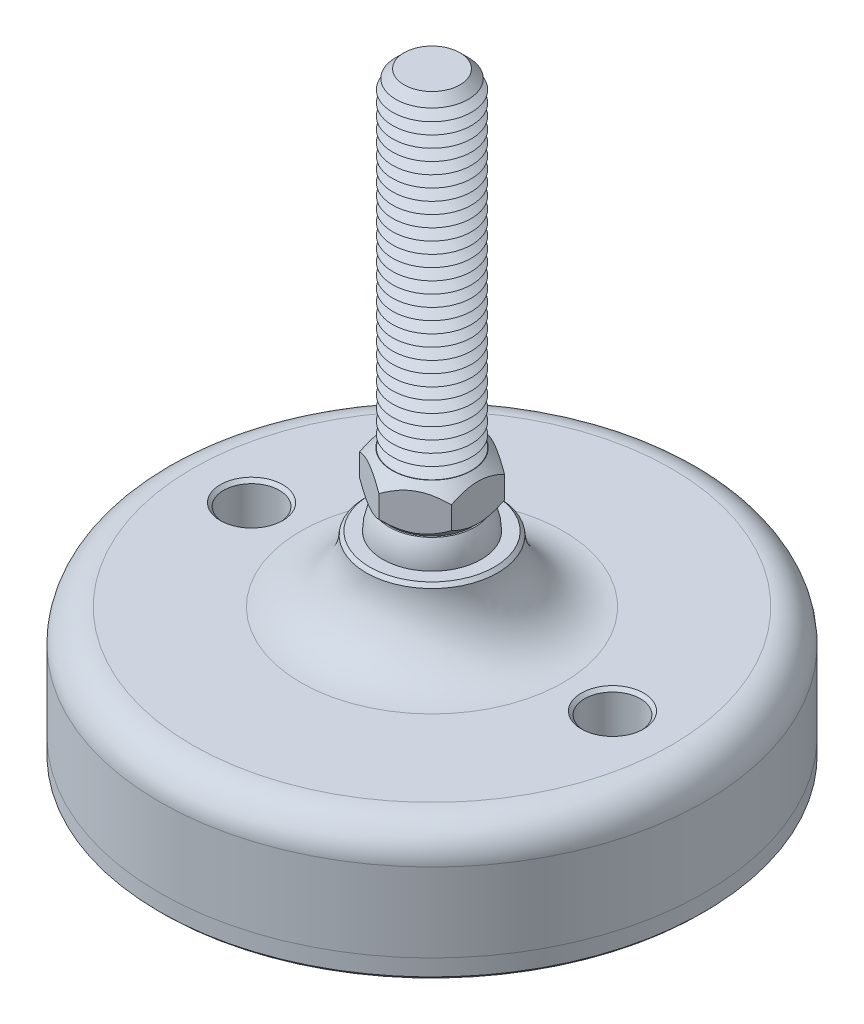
ISO-10303-21;
HEADER;
FILE_DESCRIPTION(('STEP AP214'),'2;1');
FILE_NAME('part.step','',(''),(''),'','','');
FILE_SCHEMA(('AUTOMOTIVE_DESIGN { 1 0 10303 214 1 1 1 1 }'));
ENDSEC;
DATA;
#1=APPLICATION_CONTEXT('core data for automotive mechanical design processes');
#2=APPLICATION_PROTOCOL_DEFINITION('international standard','automotive_design',2000,#1);
#3=PRODUCT_CONTEXT('',#1,'mechanical');
#4=PRODUCT('Part','Part','',(#3));
#5=PRODUCT_RELATED_PRODUCT_CATEGORY('part','',(#4));
#6=PRODUCT_DEFINITION_FORMATION('','',#4);
#7=PRODUCT_DEFINITION_CONTEXT('part definition',#1,'design');
#8=PRODUCT_DEFINITION('design','',#6,#7);
#9=PRODUCT_DEFINITION_SHAPE('','',#8);
#10=(LENGTH_UNIT() NAMED_UNIT(*) SI_UNIT(.MILLI.,.METRE.));
#11=(NAMED_UNIT(*) PLANE_ANGLE_UNIT() SI_UNIT($,.RADIAN.));
#12=(NAMED_UNIT(*) SI_UNIT($,.STERADIAN.) SOLID_ANGLE_UNIT());
#13=UNCERTAINTY_MEASURE_WITH_UNIT(LENGTH_MEASURE(1.E-05),#10,'distance_accuracy_value','');
#14=(GEOMETRIC_REPRESENTATION_CONTEXT(3) GLOBAL_UNCERTAINTY_ASSIGNED_CONTEXT((#13)) GLOBAL_UNIT_ASSIGNED_CONTEXT((#10,
#11,#12)) REPRESENTATION_CONTEXT('',''));
#15=CARTESIAN_POINT('',(0.,0.,0.));
#16=DIRECTION('',(0.,0.,1.));
#17=DIRECTION('',(1.,0.,0.));
#18=AXIS2_PLACEMENT_3D('',#15,#16,#17);
#19=CARTESIAN_POINT('',(0.,-27.,0.));
#20=DIRECTION('',(0.,1.,0.));
#21=DIRECTION('',(0.,0.,1.));
#22=AXIS2_PLACEMENT_3D('',#19,#20,#21);
#23=PLANE('',#22);
#24=CARTESIAN_POINT('',(-27.5,-27.,0.));
#25=DIRECTION('',(0.,1.,0.));
#26=DIRECTION('',(0.,0.,1.));
#27=AXIS2_PLACEMENT_3D('',#24,#25,#26);
#28=CIRCLE('',#27,4.25000000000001);
#29=CARTESIAN_POINT('',(-27.5,-27.,4.25000000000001));
#30=VERTEX_POINT('',#29);
#31=EDGE_CURVE('P0_E43',#30,#30,#28,.T.);
#32=ORIENTED_EDGE('',*,*,#31,.F.);
#33=EDGE_LOOP('',(#32));
#34=FACE_BOUND('',#33,.T.);
#35=CARTESIAN_POINT('',(27.5,-27.,0.));
#36=DIRECTION('',(0.,1.,0.));
#37=DIRECTION('',(0.,0.,1.));
#38=AXIS2_PLACEMENT_3D('',#35,#36,#37);
#39=CIRCLE('',#38,4.25000000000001);
#40=CARTESIAN_POINT('',(27.5,-27.,4.25000000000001));
#41=VERTEX_POINT('',#40);
#42=EDGE_CURVE('P0_E44',#41,#41,#39,.T.);
#43=ORIENTED_EDGE('',*,*,#42,.F.);
#44=EDGE_LOOP('',(#43));
#45=FACE_BOUND('',#44,.T.);
#46=CARTESIAN_POINT('',(0.,-27.,0.));
#47=DIRECTION('',(0.,1.,0.));
#48=DIRECTION('',(0.,0.,1.));
#49=AXIS2_PLACEMENT_3D('',#46,#47,#48);
#50=CIRCLE('',#49,41.5);
#51=CARTESIAN_POINT('',(0.,-27.,41.5));
#52=VERTEX_POINT('',#51);
#53=EDGE_CURVE('P0_E40',#52,#52,#50,.T.);
#54=ORIENTED_EDGE('',*,*,#53,.T.);
#55=EDGE_LOOP('',(#54));
#56=FACE_BOUND('',#55,.T.);
#57=ADVANCED_FACE('P0_F14',(#34,#45,#56),#23,.T.);
#58=CARTESIAN_POINT('',(0.,48.1654938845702,0.));
#59=DIRECTION('',(0.,1.,0.));
#60=DIRECTION('',(0.,0.,1.));
#61=AXIS2_PLACEMENT_3D('',#58,#59,#60);
#62=CYLINDRICAL_SURFACE('',#61,41.5);
#63=CARTESIAN_POINT('',(0.,-29.5,0.));
#64=DIRECTION('',(0.,-1.,0.));
#65=DIRECTION('',(0.,0.,-1.));
#66=AXIS2_PLACEMENT_3D('',#63,#64,#65);
#67=CIRCLE('',#66,41.5);
#68=CARTESIAN_POINT('',(0.,-29.5,-41.5));
#69=VERTEX_POINT('',#68);
#70=EDGE_CURVE('P0_E37',#69,#69,#67,.F.);
#71=ORIENTED_EDGE('',*,*,#70,.T.);
#72=EDGE_LOOP('',(#71));
#73=FACE_BOUND('',#72,.T.);
#74=ORIENTED_EDGE('',*,*,#53,.F.);
#75=EDGE_LOOP('',(#74));
#76=FACE_BOUND('',#75,.T.);
#77=ADVANCED_FACE('P0_F54',(#73,#76),#62,.T.);
#78=CARTESIAN_POINT('',(0.,-30.,41.5));
#79=DIRECTION('',(0.,-1.,0.));
#80=DIRECTION('',(0.,0.,-1.));
#81=AXIS2_PLACEMENT_3D('',#78,#79,#80);
#82=PLANE('',#81);
#83=CARTESIAN_POINT('',(27.5,-30.,0.));
#84=DIRECTION('',(0.,-1.,0.));
#85=DIRECTION('',(0.,0.,-1.));
#86=AXIS2_PLACEMENT_3D('',#83,#84,#85);
#87=CIRCLE('',#86,4.75);
#88=CARTESIAN_POINT('',(27.5,-30.,-4.75000000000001));
#89=VERTEX_POINT('',#88);
#90=EDGE_CURVE('P0_E25',#89,#89,#87,.F.);
#91=ORIENTED_EDGE('',*,*,#90,.T.);
#92=EDGE_LOOP('',(#91));
#93=FACE_BOUND('',#92,.T.);
#94=CARTESIAN_POINT('',(-27.5,-30.,0.));
#95=DIRECTION('',(0.,-1.,0.));
#96=DIRECTION('',(0.,0.,-1.));
#97=AXIS2_PLACEMENT_3D('',#94,#95,#96);
#98=CIRCLE('',#97,4.75);
#99=CARTESIAN_POINT('',(-27.5,-30.,-4.75));
#100=VERTEX_POINT('',#99);
#101=EDGE_CURVE('P0_E29',#100,#100,#98,.F.);
#102=ORIENTED_EDGE('',*,*,#101,.T.);
#103=EDGE_LOOP('',(#102));
#104=FACE_BOUND('',#103,.T.);
#105=CARTESIAN_POINT('',(0.,-30.,0.));
#106=DIRECTION('',(0.,-1.,0.));
#107=DIRECTION('',(0.,0.,-1.));
#108=AXIS2_PLACEMENT_3D('',#105,#106,#107);
#109=CIRCLE('',#108,41.);
#110=CARTESIAN_POINT('',(0.,-30.,-41.));
#111=VERTEX_POINT('',#110);
#112=EDGE_CURVE('P0_E34',#111,#111,#109,.T.);
#113=ORIENTED_EDGE('',*,*,#112,.T.);
#114=EDGE_LOOP('',(#113));
#115=FACE_BOUND('',#114,.T.);
#116=ADVANCED_FACE('P0_F61',(#93,#104,#115),#82,.T.);
#117=CARTESIAN_POINT('',(0.,-29.5,0.));
#118=DIRECTION('',(0.,1.,0.));
#119=DIRECTION('',(0.,0.,1.));
#120=AXIS2_PLACEMENT_3D('',#117,#118,#119);
#121=CONICAL_SURFACE('',#120,41.5,0.785398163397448);
#122=ORIENTED_EDGE('',*,*,#112,.F.);
#123=EDGE_LOOP('',(#122));
#124=FACE_BOUND('',#123,.T.);
#125=ORIENTED_EDGE('',*,*,#70,.F.);
#126=EDGE_LOOP('',(#125));
#127=FACE_BOUND('',#126,.T.);
#128=ADVANCED_FACE('P0_F68',(#124,#127),#121,.T.);
#129=CARTESIAN_POINT('',(27.5,-30.,0.));
#130=DIRECTION('',(0.,1.,0.));
#131=DIRECTION('',(0.,0.,1.));
#132=AXIS2_PLACEMENT_3D('',#129,#130,#131);
#133=CYLINDRICAL_SURFACE('',#132,4.25000000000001);
#134=CARTESIAN_POINT('',(27.5,-29.5,0.));
#135=DIRECTION('',(0.,-1.,0.));
#136=DIRECTION('',(0.,0.,-1.));
#137=AXIS2_PLACEMENT_3D('',#134,#135,#136);
#138=CIRCLE('',#137,4.25000000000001);
#139=CARTESIAN_POINT('',(27.5,-29.5,-4.25000000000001));
#140=VERTEX_POINT('',#139);
#141=EDGE_CURVE('P0_E21',#140,#140,#138,.T.);
#142=ORIENTED_EDGE('',*,*,#141,.T.);
#143=EDGE_LOOP('',(#142));
#144=FACE_BOUND('',#143,.T.);
#145=ORIENTED_EDGE('',*,*,#42,.T.);
#146=EDGE_LOOP('',(#145));
#147=FACE_BOUND('',#146,.T.);
#148=ADVANCED_FACE('P0_F74',(#144,#147),#133,.F.);
#149=CARTESIAN_POINT('',(-27.5,-30.,0.));
#150=DIRECTION('',(0.,1.,0.));
#151=DIRECTION('',(0.,0.,1.));
#152=AXIS2_PLACEMENT_3D('',#149,#150,#151);
#153=CYLINDRICAL_SURFACE('',#152,4.25000000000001);
#154=CARTESIAN_POINT('',(-27.5,-29.5,0.));
#155=DIRECTION('',(0.,-1.,0.));
#156=DIRECTION('',(0.,0.,-1.));
#157=AXIS2_PLACEMENT_3D('',#154,#155,#156);
#158=CIRCLE('',#157,4.25000000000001);
#159=CARTESIAN_POINT('',(-27.5,-29.5,-4.25000000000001));
#160=VERTEX_POINT('',#159);
#161=EDGE_CURVE('P0_E10',#160,#160,#158,.T.);
#162=ORIENTED_EDGE('',*,*,#161,.T.);
#163=EDGE_LOOP('',(#162));
#164=FACE_BOUND('',#163,.T.);
#165=ORIENTED_EDGE('',*,*,#31,.T.);
#166=EDGE_LOOP('',(#165));
#167=FACE_BOUND('',#166,.T.);
#168=ADVANCED_FACE('P0_F50',(#164,#167),#153,.F.);
#169=CARTESIAN_POINT('',(27.5,-30.,0.));
#170=DIRECTION('',(0.,-1.,0.));
#171=DIRECTION('',(0.,0.,-1.));
#172=AXIS2_PLACEMENT_3D('',#169,#170,#171);
#173=CONICAL_SURFACE('',#172,4.75,0.785398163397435);
#174=ORIENTED_EDGE('',*,*,#141,.F.);
#175=EDGE_LOOP('',(#174));
#176=FACE_BOUND('',#175,.T.);
#177=ORIENTED_EDGE('',*,*,#90,.F.);
#178=EDGE_LOOP('',(#177));
#179=FACE_BOUND('',#178,.T.);
#180=ADVANCED_FACE('P0_F76',(#176,#179),#173,.F.);
#181=CARTESIAN_POINT('',(-27.5,-30.,0.));
#182=DIRECTION('',(0.,-1.,0.));
#183=DIRECTION('',(0.,0.,-1.));
#184=AXIS2_PLACEMENT_3D('',#181,#182,#183);
#185=CONICAL_SURFACE('',#184,4.75,0.785398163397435);
#186=ORIENTED_EDGE('',*,*,#161,.F.);
#187=EDGE_LOOP('',(#186));
#188=FACE_BOUND('',#187,.T.);
#189=ORIENTED_EDGE('',*,*,#101,.F.);
#190=EDGE_LOOP('',(#189));
#191=FACE_BOUND('',#190,.T.);
#192=ADVANCED_FACE('P0_F16',(#188,#191),#185,.F.);
#193=CLOSED_SHELL('',(#57,#77,#116,#128,#148,#168,#180,#192));
#194=MANIFOLD_SOLID_BREP('P0_B1',#193);
#195=CARTESIAN_POINT('',(0.,0.,0.));
#196=DIRECTION('',(0.,1.,0.));
#197=DIRECTION('',(0.,0.,-1.));
#198=AXIS2_PLACEMENT_3D('',#195,#196,#197);
#199=SPHERICAL_SURFACE('',#198,7.5);
#200=CARTESIAN_POINT('',(0.,3.75,0.));
#201=DIRECTION('',(0.,-1.,0.));
#202=DIRECTION('',(0.,0.,-1.));
#203=AXIS2_PLACEMENT_3D('',#200,#201,#202);
#204=CIRCLE('',#203,6.49519052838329);
#205=CARTESIAN_POINT('',(0.,3.75,-6.49519052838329));
#206=VERTEX_POINT('',#205);
#207=EDGE_CURVE('P1_E211',#206,#206,#204,.F.);
#208=ORIENTED_EDGE('',*,*,#207,.F.);
#209=EDGE_LOOP('',(#208));
#210=FACE_BOUND('',#209,.T.);
#211=ADVANCED_FACE('P1_F16',(#210),#199,.T.);
#212=CARTESIAN_POINT('',(0.,3.75,0.));
#213=DIRECTION('',(0.,1.,0.));
#214=DIRECTION('',(0.,0.,1.));
#215=AXIS2_PLACEMENT_3D('',#212,#213,#214);
#216=CONICAL_SURFACE('',#215,6.26419292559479,0.785398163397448);
#217=CARTESIAN_POINT('',(0.,3.75,0.));
#218=DIRECTION('',(0.,1.,0.));
#219=DIRECTION('',(0.,0.,1.));
#220=AXIS2_PLACEMENT_3D('',#217,#218,#219);
#221=CIRCLE('',#220,6.26419292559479);
#222=CARTESIAN_POINT('',(0.,3.75,6.26419292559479));
#223=VERTEX_POINT('',#222);
#224=EDGE_CURVE('P1_E215',#223,#223,#221,.T.);
#225=ORIENTED_EDGE('',*,*,#224,.T.);
#226=EDGE_LOOP('',(#225));
#227=FACE_BOUND('',#226,.T.);
#228=CARTESIAN_POINT('',(-7.,8.22175145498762,-8.1400553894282));
#229=CARTESIAN_POINT('',(-7.,8.07177748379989,-7.94220937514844));
#230=CARTESIAN_POINT('',(-7.,7.92322959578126,-7.74326459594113));
#231=CARTESIAN_POINT('',(-7.,7.62962733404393,-7.34274065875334));
#232=CARTESIAN_POINT('',(-7.,7.48457383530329,-7.14116086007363));
#233=CARTESIAN_POINT('',(-7.,7.19756981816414,-6.73345531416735));
#234=CARTESIAN_POINT('',(-7.,7.05565202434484,-6.52730645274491));
#235=CARTESIAN_POINT('',(-7.,6.77703382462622,-6.11152362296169));
#236=CARTESIAN_POINT('',(-7.,6.64033305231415,-5.90188990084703));
#237=CARTESIAN_POINT('',(-7.,6.36550740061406,-5.46619755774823));
#238=CARTESIAN_POINT('',(-7.,6.22776674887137,-5.23989534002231));
#239=CARTESIAN_POINT('',(-7.,5.96123372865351,-4.78200028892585));
#240=CARTESIAN_POINT('',(-7.,5.83244279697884,-4.55040661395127));
#241=CARTESIAN_POINT('',(-7.,5.58658047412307,-4.08193183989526));
#242=CARTESIAN_POINT('',(-7.,5.46947462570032,-3.8450689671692));
#243=CARTESIAN_POINT('',(-7.,5.24960465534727,-3.36483104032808));
#244=CARTESIAN_POINT('',(-7.,5.14683397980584,-3.12145902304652));
#245=CARTESIAN_POINT('',(-7.,4.96723655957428,-2.64866791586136));
#246=CARTESIAN_POINT('',(-7.,4.88895097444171,-2.41980876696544));
#247=CARTESIAN_POINT('',(-7.,4.75072959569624,-1.9565107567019));
#248=CARTESIAN_POINT('',(-7.,4.69079504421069,-1.72207151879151));
#249=CARTESIAN_POINT('',(-7.,4.59342684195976,-1.25295119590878));
#250=CARTESIAN_POINT('',(-7.,4.5556027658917,-1.01835249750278));
#251=CARTESIAN_POINT('',(-7.,4.50320231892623,-0.546559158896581));
#252=CARTESIAN_POINT('',(-7.,4.48862178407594,-0.309364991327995));
#253=CARTESIAN_POINT('',(-7.,4.48382612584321,0.156313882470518));
#254=CARTESIAN_POINT('',(-7.,4.49271264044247,0.384789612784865));
#255=CARTESIAN_POINT('',(-7.,4.53235928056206,0.839822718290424));
#256=CARTESIAN_POINT('',(-7.,4.56312150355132,1.06637990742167));
#257=CARTESIAN_POINT('',(-7.,4.64535130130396,1.51976805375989));
#258=CARTESIAN_POINT('',(-7.,4.69717402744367,1.74653354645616));
#259=CARTESIAN_POINT('',(-7.,4.81873728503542,2.19511331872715));
#260=CARTESIAN_POINT('',(-7.,4.88847641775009,2.41692798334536));
#261=CARTESIAN_POINT('',(-7.,5.04951755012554,2.87389766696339));
#262=CARTESIAN_POINT('',(-7.,5.14215063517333,3.10857869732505));
#263=CARTESIAN_POINT('',(-7.,5.3416605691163,3.57185972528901));
#264=CARTESIAN_POINT('',(-7.,5.44854400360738,3.80045685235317));
#265=CARTESIAN_POINT('',(-7.,5.6740138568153,4.25267813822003));
#266=CARTESIAN_POINT('',(-7.,5.79263686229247,4.47628390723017));
#267=CARTESIAN_POINT('',(-7.,6.03896666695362,4.91835509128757));
#268=CARTESIAN_POINT('',(-7.,6.16667203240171,5.13682131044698));
#269=CARTESIAN_POINT('',(-7.,6.4228595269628,5.55855563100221));
#270=CARTESIAN_POINT('',(-7.,6.55098806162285,5.76203966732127));
#271=CARTESIAN_POINT('',(-7.,6.81264959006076,6.16551366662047));
#272=CARTESIAN_POINT('',(-7.,6.94618299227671,6.36550336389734));
#273=CARTESIAN_POINT('',(-7.,7.21658951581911,6.76082742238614));
#274=CARTESIAN_POINT('',(-7.,7.35342681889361,6.95618637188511));
#275=CARTESIAN_POINT('',(-7.,7.6307324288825,7.34423185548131));
#276=CARTESIAN_POINT('',(-7.,7.77119972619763,7.53691911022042));
#277=CARTESIAN_POINT('',(-7.,7.91315155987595,7.72848711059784));
#278=B_SPLINE_CURVE_WITH_KNOTS('',3,(#228,#229,#230,#231,#232,#233,#234,#235,#236,#237,#238,
#239,#240,#241,#242,#243,#244,#245,#246,#247,#248,#249,#250,#251,#252,#253,#254,#255,#256,#257,
#258,#259,#260,#261,#262,#263,#264,#265,#266,#267,#268,#269,#270,#271,#272,#273,#274,#275,#276,
#277),.UNSPECIFIED.,.F.,.F.,(4,2,2,2,2,2,2,2,2,2,2,2,2,2,2,2,2,2,2,2,2,2,2,2,4),(0.,
0.744807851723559,1.48980030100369,2.2405614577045,2.99126978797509,3.78587980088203,
4.58061708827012,5.37293691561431,6.16489332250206,6.88989369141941,7.61494312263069,
8.32676947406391,9.0384682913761,9.72332048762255,10.4082383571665,11.1052200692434,
11.8021473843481,12.5584650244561,13.3151334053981,14.0742390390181,14.8332251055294,
15.5545151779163,16.2758598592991,16.9913609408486,17.7066651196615),.UNSPECIFIED.);
#279=CARTESIAN_POINT('',(-7.,5.56871084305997,-4.04145188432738));
#280=VERTEX_POINT('',#279);
#281=CARTESIAN_POINT('',(-7.,5.56871084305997,4.04145188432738));
#282=VERTEX_POINT('',#281);
#283=EDGE_CURVE('P1_E25',#280,#282,#278,.T.);
#284=ORIENTED_EDGE('',*,*,#283,.F.);
#285=CARTESIAN_POINT('',(0.000199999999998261,5.56882631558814,-8.0830192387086));
#286=CARTESIAN_POINT('',(-0.120159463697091,5.49934419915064,-8.01352966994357));
#287=CARTESIAN_POINT('',(-0.241444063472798,5.43199440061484,-7.94350597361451));
#288=CARTESIAN_POINT('',(-0.486045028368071,5.30220807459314,-7.80228554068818));
#289=CARTESIAN_POINT('',(-0.60936245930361,5.2397742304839,-7.73108818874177));
#290=CARTESIAN_POINT('',(-0.983781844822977,5.06028719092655,-7.51491705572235));
#291=CARTESIAN_POINT('',(-1.23805341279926,4.95181416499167,-7.36811329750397));
#292=CARTESIAN_POINT('',(-1.75081233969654,4.76606165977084,-7.07207179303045));
#293=CARTESIAN_POINT('',(-2.00916864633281,4.68831421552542,-6.92290970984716));
#294=CARTESIAN_POINT('',(-2.40095049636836,4.59837958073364,-6.69671435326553));
#295=CARTESIAN_POINT('',(-2.53212124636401,4.57286115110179,-6.62098288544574));
#296=CARTESIAN_POINT('',(-2.79557335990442,4.53129725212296,-6.4688787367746));
#297=CARTESIAN_POINT('',(-2.92785455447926,4.5152503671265,-6.39250615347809));
#298=CARTESIAN_POINT('',(-3.25020698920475,4.48834537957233,-6.2063958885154));
#299=CARTESIAN_POINT('',(-3.44062555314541,4.48270029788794,-6.09645767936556));
#300=CARTESIAN_POINT('',(-3.82111946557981,4.49217587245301,-5.87677941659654));
#301=CARTESIAN_POINT('',(-4.01119467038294,4.5073038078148,-5.76703944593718));
#302=CARTESIAN_POINT('',(-4.38955306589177,4.55743368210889,-5.54859412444));
#303=CARTESIAN_POINT('',(-4.57783401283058,4.5924578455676,-5.43989006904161));
#304=CARTESIAN_POINT('',(-4.95115981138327,4.68047604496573,-5.22435031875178));
#305=CARTESIAN_POINT('',(-5.13620490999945,4.73346870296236,-5.1175144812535));
#306=CARTESIAN_POINT('',(-5.46469033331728,4.84248989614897,-4.92786333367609));
#307=CARTESIAN_POINT('',(-5.6088580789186,4.89565100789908,-4.8446280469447));
#308=CARTESIAN_POINT('',(-5.8946056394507,5.0105398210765,-4.67965161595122));
#309=CARTESIAN_POINT('',(-6.03618537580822,5.07226778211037,-4.5979105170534));
#310=CARTESIAN_POINT('',(-6.31631098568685,5.20290661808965,-4.43617992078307));
#311=CARTESIAN_POINT('',(-6.4548648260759,5.27179490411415,-4.3561858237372));
#312=CARTESIAN_POINT('',(-6.72940692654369,5.41585000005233,-4.19767886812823));
#313=CARTESIAN_POINT('',(-6.86539669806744,5.49101295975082,-4.11916513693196));
#314=CARTESIAN_POINT('',(-7.0002,5.56882631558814,-4.04133641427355));
#315=B_SPLINE_CURVE_WITH_KNOTS('',3,(#285,#286,#287,#288,#289,#290,#291,#292,#293,#294,#295,
#296,#297,#298,#299,#300,#301,#302,#303,#304,#305,#306,#307,#308,#309,#310,#311,#312,#313,#314),
.UNSPECIFIED.,.F.,.F.,(4,2,2,2,2,2,2,2,2,2,2,2,2,2,4),(0.,0.466112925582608,0.932478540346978,
1.87024464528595,2.79312018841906,3.25365289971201,3.71411676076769,4.37293813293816,
5.03199042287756,5.69178034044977,6.35151967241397,6.8755322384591,7.39956068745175,
7.92198344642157,8.44408796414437),.UNSPECIFIED.);
#316=CARTESIAN_POINT('',(0.,5.56871084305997,-8.08290376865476));
#317=VERTEX_POINT('',#316);
#318=EDGE_CURVE('P1_E116',#317,#280,#315,.T.);
#319=ORIENTED_EDGE('',*,*,#318,.F.);
#320=CARTESIAN_POINT('',(7.00019999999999,5.56882631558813,-4.04133641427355));
#321=CARTESIAN_POINT('',(6.8798405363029,5.49934419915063,-4.11082598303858));
#322=CARTESIAN_POINT('',(6.7585559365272,5.43199440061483,-4.18084967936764));
#323=CARTESIAN_POINT('',(6.51395497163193,5.30220807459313,-4.32207011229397));
#324=CARTESIAN_POINT('',(6.39063754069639,5.2397742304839,-4.39326746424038));
#325=CARTESIAN_POINT('',(6.01621815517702,5.06028719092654,-4.6094385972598));
#326=CARTESIAN_POINT('',(5.76194658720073,4.95181416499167,-4.75624235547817));
#327=CARTESIAN_POINT('',(5.24918766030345,4.76606165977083,-5.0522838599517));
#328=CARTESIAN_POINT('',(4.99083135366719,4.68831421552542,-5.20144594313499));
#329=CARTESIAN_POINT('',(4.59904950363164,4.59837958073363,-5.42764129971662));
#330=CARTESIAN_POINT('',(4.46787875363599,4.57286115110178,-5.50337276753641));
#331=CARTESIAN_POINT('',(4.20442664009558,4.53129725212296,-5.65547691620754));
#332=CARTESIAN_POINT('',(4.07214544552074,4.5152503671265,-5.73184949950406));
#333=CARTESIAN_POINT('',(3.74979301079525,4.48834537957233,-5.91795976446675));
#334=CARTESIAN_POINT('',(3.55937444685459,4.48270029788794,-6.02789797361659));
#335=CARTESIAN_POINT('',(3.17888053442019,4.49217587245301,-6.2475762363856));
#336=CARTESIAN_POINT('',(2.98880532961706,4.5073038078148,-6.35731620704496));
#337=CARTESIAN_POINT('',(2.61044693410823,4.55743368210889,-6.57576152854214));
#338=CARTESIAN_POINT('',(2.42216598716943,4.5924578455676,-6.68446558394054));
#339=CARTESIAN_POINT('',(2.04884018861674,4.68047604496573,-6.90000533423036));
#340=CARTESIAN_POINT('',(1.86379509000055,4.73346870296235,-7.00684117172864));
#341=CARTESIAN_POINT('',(1.53530966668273,4.84248989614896,-7.19649231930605));
#342=CARTESIAN_POINT('',(1.3911419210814,4.89565100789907,-7.27972760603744));
#343=CARTESIAN_POINT('',(1.1053943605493,5.0105398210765,-7.44470403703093));
#344=CARTESIAN_POINT('',(0.96381462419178,5.07226778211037,-7.52644513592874));
#345=CARTESIAN_POINT('',(0.683689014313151,5.20290661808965,-7.68817573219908));
#346=CARTESIAN_POINT('',(0.545135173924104,5.27179490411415,-7.76816982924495));
#347=CARTESIAN_POINT('',(0.270593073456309,5.41585000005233,-7.92667678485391));
#348=CARTESIAN_POINT('',(0.134603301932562,5.49101295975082,-8.00519051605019));
#349=CARTESIAN_POINT('',(-0.00020000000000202,5.56882631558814,-8.0830192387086));
#350=B_SPLINE_CURVE_WITH_KNOTS('',3,(#320,#321,#322,#323,#324,#325,#326,#327,#328,#329,#330,
#331,#332,#333,#334,#335,#336,#337,#338,#339,#340,#341,#342,#343,#344,#345,#346,#347,#348,#349),
.UNSPECIFIED.,.F.,.F.,(4,2,2,2,2,2,2,2,2,2,2,2,2,2,4),(0.,0.466112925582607,0.932478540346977,
1.87024464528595,2.79312018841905,3.25365289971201,3.71411676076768,4.37293813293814,
5.03199042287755,5.69178034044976,6.35151967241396,6.87553223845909,7.39956068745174,
7.92198344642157,8.44408796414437),.UNSPECIFIED.);
#351=CARTESIAN_POINT('',(7.,5.56871084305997,-4.04145188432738));
#352=VERTEX_POINT('',#351);
#353=EDGE_CURVE('P1_E123',#352,#317,#350,.T.);
#354=ORIENTED_EDGE('',*,*,#353,.F.);
#355=CARTESIAN_POINT('',(6.99999999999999,8.22175145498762,-8.1400553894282));
#356=CARTESIAN_POINT('',(6.99999999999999,8.07177748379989,-7.94220937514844));
#357=CARTESIAN_POINT('',(6.99999999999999,7.92322959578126,-7.74326459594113));
#358=CARTESIAN_POINT('',(6.99999999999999,7.62962733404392,-7.34274065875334));
#359=CARTESIAN_POINT('',(6.99999999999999,7.48457383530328,-7.14116086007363));
#360=CARTESIAN_POINT('',(6.99999999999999,7.19756981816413,-6.73345531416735));
#361=CARTESIAN_POINT('',(6.99999999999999,7.05565202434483,-6.52730645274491));
#362=CARTESIAN_POINT('',(6.99999999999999,6.77703382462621,-6.11152362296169));
#363=CARTESIAN_POINT('',(6.99999999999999,6.64033305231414,-5.90188990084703));
#364=CARTESIAN_POINT('',(6.99999999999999,6.36550740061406,-5.46619755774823));
#365=CARTESIAN_POINT('',(6.99999999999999,6.22776674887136,-5.23989534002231));
#366=CARTESIAN_POINT('',(6.99999999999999,5.9612337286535,-4.78200028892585));
#367=CARTESIAN_POINT('',(6.99999999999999,5.83244279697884,-4.55040661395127));
#368=CARTESIAN_POINT('',(6.99999999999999,5.58658047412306,-4.08193183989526));
#369=CARTESIAN_POINT('',(6.99999999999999,5.46947462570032,-3.8450689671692));
#370=CARTESIAN_POINT('',(6.99999999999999,5.24960465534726,-3.36483104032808));
#371=CARTESIAN_POINT('',(6.99999999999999,5.14683397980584,-3.12145902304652));
#372=CARTESIAN_POINT('',(6.99999999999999,4.96723655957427,-2.64866791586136));
#373=CARTESIAN_POINT('',(6.99999999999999,4.88895097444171,-2.41980876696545));
#374=CARTESIAN_POINT('',(6.99999999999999,4.75072959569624,-1.9565107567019));
#375=CARTESIAN_POINT('',(6.99999999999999,4.69079504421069,-1.72207151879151));
#376=CARTESIAN_POINT('',(6.99999999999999,4.59342684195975,-1.25295119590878));
#377=CARTESIAN_POINT('',(6.99999999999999,4.5556027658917,-1.01835249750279));
#378=CARTESIAN_POINT('',(6.99999999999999,4.50320231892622,-0.546559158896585));
#379=CARTESIAN_POINT('',(6.99999999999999,4.48862178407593,-0.309364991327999));
#380=CARTESIAN_POINT('',(6.99999999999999,4.48382612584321,0.156313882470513));
#381=CARTESIAN_POINT('',(6.99999999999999,4.49271264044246,0.38478961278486));
#382=CARTESIAN_POINT('',(6.99999999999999,4.53235928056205,0.83982271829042));
#383=CARTESIAN_POINT('',(6.99999999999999,4.56312150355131,1.06637990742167));
#384=CARTESIAN_POINT('',(6.99999999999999,4.64535130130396,1.51976805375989));
#385=CARTESIAN_POINT('',(6.99999999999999,4.69717402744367,1.74653354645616));
#386=CARTESIAN_POINT('',(6.99999999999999,4.81873728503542,2.19511331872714));
#387=CARTESIAN_POINT('',(7.,4.88847641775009,2.41692798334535));
#388=CARTESIAN_POINT('',(7.,5.04951755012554,2.87389766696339));
#389=CARTESIAN_POINT('',(7.,5.14215063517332,3.10857869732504));
#390=CARTESIAN_POINT('',(7.,5.34166056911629,3.571859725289));
#391=CARTESIAN_POINT('',(7.,5.44854400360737,3.80045685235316));
#392=CARTESIAN_POINT('',(7.,5.67401385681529,4.25267813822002));
#393=CARTESIAN_POINT('',(7.,5.79263686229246,4.47628390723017));
#394=CARTESIAN_POINT('',(7.,6.03896666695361,4.91835509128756));
#395=CARTESIAN_POINT('',(7.,6.1666720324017,5.13682131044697));
#396=CARTESIAN_POINT('',(7.,6.42285952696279,5.5585556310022));
#397=CARTESIAN_POINT('',(7.,6.55098806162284,5.76203966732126));
#398=CARTESIAN_POINT('',(7.,6.81264959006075,6.16551366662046));
#399=CARTESIAN_POINT('',(7.,6.9461829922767,6.36550336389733));
#400=CARTESIAN_POINT('',(7.,7.21658951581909,6.76082742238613));
#401=CARTESIAN_POINT('',(7.,7.3534268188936,6.9561863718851));
#402=CARTESIAN_POINT('',(7.,7.63073242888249,7.3442318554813));
#403=CARTESIAN_POINT('',(7.,7.77119972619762,7.53691911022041));
#404=CARTESIAN_POINT('',(7.,7.91315155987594,7.72848711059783));
#405=B_SPLINE_CURVE_WITH_KNOTS('',3,(#355,#356,#357,#358,#359,#360,#361,#362,#363,#364,#365,
#366,#367,#368,#369,#370,#371,#372,#373,#374,#375,#376,#377,#378,#379,#380,#381,#382,#383,#384,
#385,#386,#387,#388,#389,#390,#391,#392,#393,#394,#395,#396,#397,#398,#399,#400,#401,#402,#403,
#404),.UNSPECIFIED.,.F.,.F.,(4,2,2,2,2,2,2,2,2,2,2,2,2,2,2,2,2,2,2,2,2,2,2,2,4),(0.,
0.744807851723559,1.48980030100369,2.2405614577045,2.9912697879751,3.78587980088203,
4.58061708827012,5.3729369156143,6.16489332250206,6.8898936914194,7.61494312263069,
8.32676947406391,9.03846829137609,9.72332048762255,10.4082383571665,11.1052200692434,
11.8021473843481,12.5584650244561,13.3151334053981,14.0742390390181,14.8332251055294,
15.5545151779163,16.275859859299,16.9913609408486,17.7066651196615),.UNSPECIFIED.);
#406=CARTESIAN_POINT('',(6.99999999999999,5.56871084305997,4.04145188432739));
#407=VERTEX_POINT('',#406);
#408=EDGE_CURVE('P1_E71',#407,#352,#405,.F.);
#409=ORIENTED_EDGE('',*,*,#408,.F.);
#410=CARTESIAN_POINT('',(-0.000200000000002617,5.56882631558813,8.0830192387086));
#411=CARTESIAN_POINT('',(0.120159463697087,5.49934419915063,8.01352966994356));
#412=CARTESIAN_POINT('',(0.241444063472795,5.43199440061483,7.9435059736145));
#413=CARTESIAN_POINT('',(0.486045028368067,5.30220807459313,7.80228554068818));
#414=CARTESIAN_POINT('',(0.609362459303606,5.2397742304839,7.73108818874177));
#415=CARTESIAN_POINT('',(0.983781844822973,5.06028719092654,7.51491705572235));
#416=CARTESIAN_POINT('',(1.23805341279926,4.95181416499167,7.36811329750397));
#417=CARTESIAN_POINT('',(1.75081233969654,4.76606165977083,7.07207179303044));
#418=CARTESIAN_POINT('',(2.00916864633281,4.68831421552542,6.92290970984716));
#419=CARTESIAN_POINT('',(2.40095049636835,4.59837958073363,6.69671435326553));
#420=CARTESIAN_POINT('',(2.53212124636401,4.57286115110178,6.62098288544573));
#421=CARTESIAN_POINT('',(2.79557335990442,4.53129725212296,6.4688787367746));
#422=CARTESIAN_POINT('',(2.92785455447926,4.5152503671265,6.39250615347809));
#423=CARTESIAN_POINT('',(3.25020698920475,4.48834537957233,6.2063958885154));
#424=CARTESIAN_POINT('',(3.44062555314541,4.48270029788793,6.09645767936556));
#425=CARTESIAN_POINT('',(3.82111946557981,4.492175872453,5.87677941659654));
#426=CARTESIAN_POINT('',(4.01119467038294,4.5073038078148,5.76703944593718));
#427=CARTESIAN_POINT('',(4.38955306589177,4.55743368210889,5.54859412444));
#428=CARTESIAN_POINT('',(4.57783401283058,4.5924578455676,5.4398900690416));
#429=CARTESIAN_POINT('',(4.95115981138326,4.68047604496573,5.22435031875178));
#430=CARTESIAN_POINT('',(5.13620490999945,4.73346870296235,5.1175144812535));
#431=CARTESIAN_POINT('',(5.46469033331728,4.84248989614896,4.92786333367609));
#432=CARTESIAN_POINT('',(5.6088580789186,4.89565100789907,4.8446280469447));
#433=CARTESIAN_POINT('',(5.8946056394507,5.01053982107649,4.67965161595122));
#434=CARTESIAN_POINT('',(6.03618537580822,5.07226778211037,4.5979105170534));
#435=CARTESIAN_POINT('',(6.31631098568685,5.20290661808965,4.43617992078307));
#436=CARTESIAN_POINT('',(6.45486482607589,5.27179490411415,4.3561858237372));
#437=CARTESIAN_POINT('',(6.72940692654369,5.41585000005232,4.19767886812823));
#438=CARTESIAN_POINT('',(6.86539669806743,5.49101295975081,4.11916513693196));
#439=CARTESIAN_POINT('',(7.00019999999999,5.56882631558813,4.04133641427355));
#440=B_SPLINE_CURVE_WITH_KNOTS('',3,(#410,#411,#412,#413,#414,#415,#416,#417,#418,#419,#420,
#421,#422,#423,#424,#425,#426,#427,#428,#429,#430,#431,#432,#433,#434,#435,#436,#437,#438,#439),
.UNSPECIFIED.,.F.,.F.,(4,2,2,2,2,2,2,2,2,2,2,2,2,2,4),(0.,0.466112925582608,0.932478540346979,
1.87024464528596,2.79312018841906,3.25365289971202,3.71411676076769,4.37293813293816,
5.03199042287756,5.69178034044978,6.35151967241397,6.8755322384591,7.39956068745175,
7.92198344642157,8.44408796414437),.UNSPECIFIED.);
#441=CARTESIAN_POINT('',(0.,5.56871084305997,8.08290376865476));
#442=VERTEX_POINT('',#441);
#443=EDGE_CURVE('P1_E68',#442,#407,#440,.T.);
#444=ORIENTED_EDGE('',*,*,#443,.F.);
#445=CARTESIAN_POINT('',(-7.0002,5.56882631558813,4.04133641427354));
#446=CARTESIAN_POINT('',(-6.87984053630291,5.49934419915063,4.11082598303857));
#447=CARTESIAN_POINT('',(-6.7585559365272,5.43199440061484,4.18084967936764));
#448=CARTESIAN_POINT('',(-6.51395497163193,5.30220807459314,4.32207011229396));
#449=CARTESIAN_POINT('',(-6.39063754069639,5.2397742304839,4.39326746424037));
#450=CARTESIAN_POINT('',(-6.01621815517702,5.06028719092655,4.60943859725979));
#451=CARTESIAN_POINT('',(-5.76194658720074,4.95181416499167,4.75624235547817));
#452=CARTESIAN_POINT('',(-5.24918766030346,4.76606165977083,5.0522838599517));
#453=CARTESIAN_POINT('',(-4.99083135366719,4.68831421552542,5.20144594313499));
#454=CARTESIAN_POINT('',(-4.59904950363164,4.59837958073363,5.42764129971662));
#455=CARTESIAN_POINT('',(-4.46787875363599,4.57286115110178,5.50337276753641));
#456=CARTESIAN_POINT('',(-4.20442664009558,4.53129725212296,5.65547691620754));
#457=CARTESIAN_POINT('',(-4.07214544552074,4.5152503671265,5.73184949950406));
#458=CARTESIAN_POINT('',(-3.74979301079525,4.48834537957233,5.91795976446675));
#459=CARTESIAN_POINT('',(-3.55937444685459,4.48270029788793,6.02789797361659));
#460=CARTESIAN_POINT('',(-3.17888053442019,4.492175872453,6.2475762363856));
#461=CARTESIAN_POINT('',(-2.98880532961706,4.5073038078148,6.35731620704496));
#462=CARTESIAN_POINT('',(-2.61044693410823,4.55743368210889,6.57576152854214));
#463=CARTESIAN_POINT('',(-2.42216598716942,4.5924578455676,6.68446558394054));
#464=CARTESIAN_POINT('',(-2.04884018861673,4.68047604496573,6.90000533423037));
#465=CARTESIAN_POINT('',(-1.86379509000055,4.73346870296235,7.00684117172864));
#466=CARTESIAN_POINT('',(-1.53530966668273,4.84248989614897,7.19649231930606));
#467=CARTESIAN_POINT('',(-1.3911419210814,4.89565100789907,7.27972760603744));
#468=CARTESIAN_POINT('',(-1.1053943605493,5.01053982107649,7.44470403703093));
#469=CARTESIAN_POINT('',(-0.963814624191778,5.07226778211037,7.52644513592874));
#470=CARTESIAN_POINT('',(-0.683689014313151,5.20290661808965,7.68817573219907));
#471=CARTESIAN_POINT('',(-0.545135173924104,5.27179490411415,7.76816982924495));
#472=CARTESIAN_POINT('',(-0.270593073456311,5.41585000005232,7.92667678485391));
#473=CARTESIAN_POINT('',(-0.134603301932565,5.49101295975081,8.00519051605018));
#474=CARTESIAN_POINT('',(0.000199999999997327,5.56882631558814,8.0830192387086));
#475=B_SPLINE_CURVE_WITH_KNOTS('',3,(#445,#446,#447,#448,#449,#450,#451,#452,#453,#454,#455,
#456,#457,#458,#459,#460,#461,#462,#463,#464,#465,#466,#467,#468,#469,#470,#471,#472,#473,#474),
.UNSPECIFIED.,.F.,.F.,(4,2,2,2,2,2,2,2,2,2,2,2,2,2,4),(0.,0.466112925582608,0.93247854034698,
1.87024464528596,2.79312018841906,3.25365289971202,3.71411676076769,4.37293813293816,
5.03199042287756,5.69178034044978,6.35151967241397,6.8755322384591,7.39956068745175,
7.92198344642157,8.44408796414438),.UNSPECIFIED.);
#476=EDGE_CURVE('P1_E40',#282,#442,#475,.T.);
#477=ORIENTED_EDGE('',*,*,#476,.F.);
#478=EDGE_LOOP('',(#284,#319,#354,#409,#444,#477));
#479=FACE_BOUND('',#478,.T.);
#480=ADVANCED_FACE('P1_F69',(#227,#479),#216,.T.);
#481=CARTESIAN_POINT('',(0.,3.75,6.26419292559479));
#482=DIRECTION('',(0.,-1.,0.));
#483=DIRECTION('',(0.,0.,-1.));
#484=AXIS2_PLACEMENT_3D('',#481,#482,#483);
#485=PLANE('',#484);
#486=ORIENTED_EDGE('',*,*,#207,.T.);
#487=EDGE_LOOP('',(#486));
#488=FACE_BOUND('',#487,.T.);
#489=ORIENTED_EDGE('',*,*,#224,.F.);
#490=EDGE_LOOP('',(#489));
#491=FACE_BOUND('',#490,.T.);
#492=ADVANCED_FACE('P1_F107',(#488,#491),#485,.F.);
#493=CARTESIAN_POINT('',(-7.,11.,4.04145188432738));
#494=DIRECTION('',(0.5,0.,-0.866025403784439));
#495=DIRECTION('',(-0.866025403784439,0.,-0.5));
#496=AXIS2_PLACEMENT_3D('',#493,#494,#495);
#497=PLANE('',#496);
#498=DIRECTION('',(0.,-1.,0.));
#499=VECTOR('',#498,1.);
#500=CARTESIAN_POINT('',(0.,11.,8.08290376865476));
#501=LINE('',#500,#499);
#502=CARTESIAN_POINT('',(0.,8.97927405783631,8.08290376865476));
#503=VERTEX_POINT('',#502);
#504=EDGE_CURVE('P1_E82',#503,#442,#501,.T.);
#505=ORIENTED_EDGE('',*,*,#504,.F.);
#506=CARTESIAN_POINT('',(0.000199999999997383,8.97915858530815,8.0830192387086));
#507=CARTESIAN_POINT('',(-0.120159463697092,9.04864070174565,8.01352966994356));
#508=CARTESIAN_POINT('',(-0.241444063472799,9.11599050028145,7.9435059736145));
#509=CARTESIAN_POINT('',(-0.486045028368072,9.24577682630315,7.80228554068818));
#510=CARTESIAN_POINT('',(-0.609362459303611,9.30821067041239,7.73108818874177));
#511=CARTESIAN_POINT('',(-0.983781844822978,9.48769770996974,7.51491705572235));
#512=CARTESIAN_POINT('',(-1.23805341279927,9.59617073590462,7.36811329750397));
#513=CARTESIAN_POINT('',(-1.75081233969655,9.78192324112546,7.07207179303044));
#514=CARTESIAN_POINT('',(-2.00916864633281,9.85967068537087,6.92290970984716));
#515=CARTESIAN_POINT('',(-2.40095049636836,9.94960532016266,6.69671435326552));
#516=CARTESIAN_POINT('',(-2.53212124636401,9.9751237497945,6.62098288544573));
#517=CARTESIAN_POINT('',(-2.79557335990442,10.0166876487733,6.4688787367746));
#518=CARTESIAN_POINT('',(-2.92785455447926,10.0327345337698,6.39250615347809));
#519=CARTESIAN_POINT('',(-3.25020698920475,10.059639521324,6.2063958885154));
#520=CARTESIAN_POINT('',(-3.44062555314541,10.0652846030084,6.09645767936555));
#521=CARTESIAN_POINT('',(-3.82111946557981,10.0558090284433,5.87677941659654));
#522=CARTESIAN_POINT('',(-4.01119467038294,10.0406810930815,5.76703944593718));
#523=CARTESIAN_POINT('',(-4.38955306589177,9.9905512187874,5.54859412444));
#524=CARTESIAN_POINT('',(-4.57783401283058,9.95552705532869,5.4398900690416));
#525=CARTESIAN_POINT('',(-4.95115981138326,9.86750885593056,5.22435031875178));
#526=CARTESIAN_POINT('',(-5.13620490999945,9.81451619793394,5.1175144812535));
#527=CARTESIAN_POINT('',(-5.46469033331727,9.70549500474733,4.92786333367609));
#528=CARTESIAN_POINT('',(-5.6088580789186,9.65233389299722,4.8446280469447));
#529=CARTESIAN_POINT('',(-5.8946056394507,9.5374450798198,4.67965161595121));
#530=CARTESIAN_POINT('',(-6.03618537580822,9.47571711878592,4.5979105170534));
#531=CARTESIAN_POINT('',(-6.31631098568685,9.34507828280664,4.43617992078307));
#532=CARTESIAN_POINT('',(-6.4548648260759,9.27618999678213,4.35618582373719));
#533=CARTESIAN_POINT('',(-6.72940692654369,9.13213490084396,4.19767886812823));
#534=CARTESIAN_POINT('',(-6.86539669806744,9.05697194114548,4.11916513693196));
#535=CARTESIAN_POINT('',(-7.0002,8.97915858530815,4.04133641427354));
#536=B_SPLINE_CURVE_WITH_KNOTS('',3,(#506,#507,#508,#509,#510,#511,#512,#513,#514,#515,#516,
#517,#518,#519,#520,#521,#522,#523,#524,#525,#526,#527,#528,#529,#530,#531,#532,#533,#534,#535),
.UNSPECIFIED.,.F.,.F.,(4,2,2,2,2,2,2,2,2,2,2,2,2,2,4),(0.,0.466112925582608,0.932478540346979,
1.87024464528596,2.79312018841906,3.25365289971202,3.71411676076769,4.37293813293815,
5.03199042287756,5.69178034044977,6.35151967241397,6.87553223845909,7.39956068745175,
7.92198344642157,8.44408796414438),.UNSPECIFIED.);
#537=CARTESIAN_POINT('',(-7.,8.97927405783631,4.04145188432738));
#538=VERTEX_POINT('',#537);
#539=EDGE_CURVE('P1_E153',#503,#538,#536,.T.);
#540=ORIENTED_EDGE('',*,*,#539,.T.);
#541=DIRECTION('',(0.,-1.,0.));
#542=VECTOR('',#541,1.);
#543=CARTESIAN_POINT('',(-7.,11.,4.04145188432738));
#544=LINE('',#543,#542);
#545=EDGE_CURVE('P1_E84',#538,#282,#544,.T.);
#546=ORIENTED_EDGE('',*,*,#545,.T.);
#547=ORIENTED_EDGE('',*,*,#476,.T.);
#548=EDGE_LOOP('',(#505,#540,#546,#547));
#549=FACE_BOUND('',#548,.T.);
#550=ADVANCED_FACE('P1_F80',(#549),#497,.F.);
#551=CARTESIAN_POINT('',(0.,11.,8.08290376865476));
#552=DIRECTION('',(-0.5,0.,-0.866025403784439));
#553=DIRECTION('',(-0.866025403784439,0.,0.5));
#554=AXIS2_PLACEMENT_3D('',#551,#552,#553);
#555=PLANE('',#554);
#556=DIRECTION('',(0.,-1.,0.));
#557=VECTOR('',#556,1.);
#558=CARTESIAN_POINT('',(7.,11.,4.04145188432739));
#559=LINE('',#558,#557);
#560=CARTESIAN_POINT('',(7.,8.97927405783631,4.04145188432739));
#561=VERTEX_POINT('',#560);
#562=EDGE_CURVE('P1_E89',#561,#407,#559,.T.);
#563=ORIENTED_EDGE('',*,*,#562,.F.);
#564=CARTESIAN_POINT('',(7.0002,8.97915858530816,4.04133641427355));
#565=CARTESIAN_POINT('',(6.87984053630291,9.04864070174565,4.11082598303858));
#566=CARTESIAN_POINT('',(6.7585559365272,9.11599050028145,4.18084967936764));
#567=CARTESIAN_POINT('',(6.51395497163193,9.24577682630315,4.32207011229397));
#568=CARTESIAN_POINT('',(6.39063754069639,9.30821067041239,4.39326746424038));
#569=CARTESIAN_POINT('',(6.01621815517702,9.48769770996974,4.6094385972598));
#570=CARTESIAN_POINT('',(5.76194658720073,9.59617073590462,4.75624235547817));
#571=CARTESIAN_POINT('',(5.24918766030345,9.78192324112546,5.0522838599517));
#572=CARTESIAN_POINT('',(4.99083135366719,9.85967068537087,5.20144594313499));
#573=CARTESIAN_POINT('',(4.59904950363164,9.94960532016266,5.42764129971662));
#574=CARTESIAN_POINT('',(4.46787875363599,9.9751237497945,5.50337276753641));
#575=CARTESIAN_POINT('',(4.20442664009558,10.0166876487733,5.65547691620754));
#576=CARTESIAN_POINT('',(4.07214544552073,10.0327345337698,5.73184949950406));
#577=CARTESIAN_POINT('',(3.74979301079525,10.059639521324,5.91795976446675));
#578=CARTESIAN_POINT('',(3.55937444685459,10.0652846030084,6.02789797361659));
#579=CARTESIAN_POINT('',(3.17888053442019,10.0558090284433,6.2475762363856));
#580=CARTESIAN_POINT('',(2.98880532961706,10.0406810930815,6.35731620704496));
#581=CARTESIAN_POINT('',(2.61044693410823,9.9905512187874,6.57576152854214));
#582=CARTESIAN_POINT('',(2.42216598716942,9.95552705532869,6.68446558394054));
#583=CARTESIAN_POINT('',(2.04884018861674,9.86750885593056,6.90000533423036));
#584=CARTESIAN_POINT('',(1.86379509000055,9.81451619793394,7.00684117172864));
#585=CARTESIAN_POINT('',(1.53530966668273,9.70549500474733,7.19649231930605));
#586=CARTESIAN_POINT('',(1.3911419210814,9.65233389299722,7.27972760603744));
#587=CARTESIAN_POINT('',(1.1053943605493,9.5374450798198,7.44470403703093));
#588=CARTESIAN_POINT('',(0.963814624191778,9.47571711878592,7.52644513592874));
#589=CARTESIAN_POINT('',(0.683689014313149,9.34507828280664,7.68817573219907));
#590=CARTESIAN_POINT('',(0.545135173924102,9.27618999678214,7.76816982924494));
#591=CARTESIAN_POINT('',(0.270593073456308,9.13213490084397,7.92667678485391));
#592=CARTESIAN_POINT('',(0.134603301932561,9.05697194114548,8.00519051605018));
#593=CARTESIAN_POINT('',(-0.000200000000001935,8.97915858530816,8.0830192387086));
#594=B_SPLINE_CURVE_WITH_KNOTS('',3,(#564,#565,#566,#567,#568,#569,#570,#571,#572,#573,#574,
#575,#576,#577,#578,#579,#580,#581,#582,#583,#584,#585,#586,#587,#588,#589,#590,#591,#592,#593),
.UNSPECIFIED.,.F.,.F.,(4,2,2,2,2,2,2,2,2,2,2,2,2,2,4),(0.,0.466112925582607,0.932478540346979,
1.87024464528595,2.79312018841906,3.25365289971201,3.71411676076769,4.37293813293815,
5.03199042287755,5.69178034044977,6.35151967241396,6.87553223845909,7.39956068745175,
7.92198344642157,8.44408796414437),.UNSPECIFIED.);
#595=EDGE_CURVE('P1_E88',#561,#503,#594,.T.);
#596=ORIENTED_EDGE('',*,*,#595,.T.);
#597=ORIENTED_EDGE('',*,*,#504,.T.);
#598=ORIENTED_EDGE('',*,*,#443,.T.);
#599=EDGE_LOOP('',(#563,#596,#597,#598));
#600=FACE_BOUND('',#599,.T.);
#601=ADVANCED_FACE('P1_F87',(#600),#555,.F.);
#602=CARTESIAN_POINT('',(7.,11.,4.04145188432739));
#603=DIRECTION('',(-1.,0.,0.));
#604=DIRECTION('',(0.,0.,1.));
#605=AXIS2_PLACEMENT_3D('',#602,#603,#604);
#606=PLANE('',#605);
#607=DIRECTION('',(0.,-1.,0.));
#608=VECTOR('',#607,1.);
#609=CARTESIAN_POINT('',(6.99999999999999,11.,-4.04145188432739));
#610=LINE('',#609,#608);
#611=CARTESIAN_POINT('',(7.,8.97927405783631,-4.04145188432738));
#612=VERTEX_POINT('',#611);
#613=EDGE_CURVE('P1_E92',#612,#352,#610,.T.);
#614=ORIENTED_EDGE('',*,*,#613,.F.);
#615=CARTESIAN_POINT('',(6.99999999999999,6.38657431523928,-8.06030460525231));
#616=CARTESIAN_POINT('',(6.99999999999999,6.53472070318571,-7.86404504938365));
#617=CARTESIAN_POINT('',(6.99999999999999,6.68143506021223,-7.66668664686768));
#618=CARTESIAN_POINT('',(6.99999999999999,6.97135854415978,-7.26933868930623));
#619=CARTESIAN_POINT('',(6.99999999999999,7.1145667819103,-7.06934848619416));
#620=CARTESIAN_POINT('',(6.99999999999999,7.39785506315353,-6.66484054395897));
#621=CARTESIAN_POINT('',(6.99999999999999,7.53790227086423,-6.4602997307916));
#622=CARTESIAN_POINT('',(6.99999999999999,7.81276929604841,-6.04774624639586));
#623=CARTESIAN_POINT('',(6.99999999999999,7.94758948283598,-5.83973382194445));
#624=CARTESIAN_POINT('',(6.99999999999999,8.21836349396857,-5.40767991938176));
#625=CARTESIAN_POINT('',(6.99999999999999,8.35394167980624,-5.18340182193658));
#626=CARTESIAN_POINT('',(6.99999999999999,8.61617794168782,-4.72961052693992));
#627=CARTESIAN_POINT('',(6.99999999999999,8.74283460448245,-4.50009650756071));
#628=CARTESIAN_POINT('',(6.99999999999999,8.98449500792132,-4.03585471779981));
#629=CARTESIAN_POINT('',(6.99999999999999,9.09953301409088,-3.80114492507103));
#630=CARTESIAN_POINT('',(6.99999999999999,9.31538083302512,-3.32532417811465));
#631=CARTESIAN_POINT('',(6.99999999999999,9.41619708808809,-3.08421618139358));
#632=CARTESIAN_POINT('',(6.99999999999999,9.59261477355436,-2.61490679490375));
#633=CARTESIAN_POINT('',(6.99999999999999,9.66959244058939,-2.38722816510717));
#634=CARTESIAN_POINT('',(6.99999999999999,9.80528213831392,-1.92638931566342));
#635=CARTESIAN_POINT('',(6.99999999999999,9.86399291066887,-1.69322871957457));
#636=CARTESIAN_POINT('',(6.99999999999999,9.95910606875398,-1.22669621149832));
#637=CARTESIAN_POINT('',(6.99999999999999,9.9958906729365,-0.993403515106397));
#638=CARTESIAN_POINT('',(6.99999999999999,10.0464375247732,-0.524324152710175));
#639=CARTESIAN_POINT('',(6.99999999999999,10.0602037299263,-0.288537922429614));
#640=CARTESIAN_POINT('',(6.99999999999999,10.0636914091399,0.174669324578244));
#641=CARTESIAN_POINT('',(6.99999999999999,10.0542651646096,0.402084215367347));
#642=CARTESIAN_POINT('',(6.99999999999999,10.0137689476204,0.854966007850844));
#643=CARTESIAN_POINT('',(6.99999999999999,9.98269687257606,1.080432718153));
#644=CARTESIAN_POINT('',(6.99999999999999,9.90007567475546,1.53159825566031));
#645=CARTESIAN_POINT('',(6.99999999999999,9.84817808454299,1.75723223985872));
#646=CARTESIAN_POINT('',(6.99999999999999,9.72667364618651,2.20358388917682));
#647=CARTESIAN_POINT('',(7.,9.65706827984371,2.42430196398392));
#648=CARTESIAN_POINT('',(7.,9.49585307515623,2.88081008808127));
#649=CARTESIAN_POINT('',(7.,9.40279568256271,3.11608373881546));
#650=CARTESIAN_POINT('',(7.,9.20239444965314,3.58051976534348));
#651=CARTESIAN_POINT('',(7.,9.09504395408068,3.8096792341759));
#652=CARTESIAN_POINT('',(7.,8.86861061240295,4.26300681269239));
#653=CARTESIAN_POINT('',(7.,8.74949092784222,4.48715637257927));
#654=CARTESIAN_POINT('',(7.,8.50215207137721,4.93029722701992));
#655=CARTESIAN_POINT('',(7.,8.37393434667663,5.14928933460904));
#656=CARTESIAN_POINT('',(7.,8.11675254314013,5.57201416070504));
#657=CARTESIAN_POINT('',(7.,7.98814324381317,5.7759638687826));
#658=CARTESIAN_POINT('',(7.,7.72551640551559,6.1803619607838));
#659=CARTESIAN_POINT('',(7.,7.59149845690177,6.3808100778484));
#660=CARTESIAN_POINT('',(7.,7.32012806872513,6.77703781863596));
#661=CARTESIAN_POINT('',(7.,7.18281155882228,6.97284213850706));
#662=CARTESIAN_POINT('',(7.,6.90454718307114,7.36177489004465));
#663=CARTESIAN_POINT('',(7.,6.76360032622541,7.55490404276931));
#664=CARTESIAN_POINT('',(7.,6.62116922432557,7.74691297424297));
#665=B_SPLINE_CURVE_WITH_KNOTS('',3,(#615,#616,#617,#618,#619,#620,#621,#622,#623,#624,#625,
#626,#627,#628,#629,#630,#631,#632,#633,#634,#635,#636,#637,#638,#639,#640,#641,#642,#643,#644,
#645,#646,#647,#648,#649,#650,#651,#652,#653,#654,#655,#656,#657,#658,#659,#660,#661,#662,#663,
#664),.UNSPECIFIED.,.F.,.F.,(4,2,2,2,2,2,2,2,2,2,2,2,2,2,2,2,2,2,2,2,2,2,2,2,4),(0.,
0.73770456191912,1.47559431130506,2.21920144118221,2.96275593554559,3.74880908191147,
4.53498646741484,5.31877306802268,6.10220347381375,6.82258884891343,7.54302383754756,
8.2505020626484,8.95785864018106,9.63961191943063,10.3214314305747,11.0151699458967,
11.7088504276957,12.4672854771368,13.2260749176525,13.9873195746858,14.7484434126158,
15.4716843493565,16.1949801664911,16.912400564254,17.6296236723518),.UNSPECIFIED.);
#666=EDGE_CURVE('P1_E154',#612,#561,#665,.T.);
#667=ORIENTED_EDGE('',*,*,#666,.T.);
#668=ORIENTED_EDGE('',*,*,#562,.T.);
#669=ORIENTED_EDGE('',*,*,#408,.T.);
#670=EDGE_LOOP('',(#614,#667,#668,#669));
#671=FACE_BOUND('',#670,.T.);
#672=ADVANCED_FACE('P1_F144',(#671),#606,.F.);
#673=CARTESIAN_POINT('',(6.99999999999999,11.,-4.04145188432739));
#674=DIRECTION('',(-0.5,0.,0.866025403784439));
#675=DIRECTION('',(0.866025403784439,0.,0.5));
#676=AXIS2_PLACEMENT_3D('',#673,#674,#675);
#677=PLANE('',#676);
#678=DIRECTION('',(0.,-1.,0.));
#679=VECTOR('',#678,1.);
#680=CARTESIAN_POINT('',(0.,11.,-8.08290376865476));
#681=LINE('',#680,#679);
#682=CARTESIAN_POINT('',(0.,8.97927405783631,-8.08290376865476));
#683=VERTEX_POINT('',#682);
#684=EDGE_CURVE('P1_E728',#683,#317,#681,.T.);
#685=ORIENTED_EDGE('',*,*,#684,.F.);
#686=CARTESIAN_POINT('',(-0.000200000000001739,8.97915858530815,-8.0830192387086));
#687=CARTESIAN_POINT('',(0.120159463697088,9.04864070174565,-8.01352966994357));
#688=CARTESIAN_POINT('',(0.241444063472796,9.11599050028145,-7.94350597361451));
#689=CARTESIAN_POINT('',(0.48604502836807,9.24577682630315,-7.80228554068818));
#690=CARTESIAN_POINT('',(0.609362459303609,9.30821067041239,-7.73108818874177));
#691=CARTESIAN_POINT('',(0.983781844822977,9.48769770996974,-7.51491705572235));
#692=CARTESIAN_POINT('',(1.23805341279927,9.59617073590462,-7.36811329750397));
#693=CARTESIAN_POINT('',(1.75081233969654,9.78192324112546,-7.07207179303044));
#694=CARTESIAN_POINT('',(2.00916864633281,9.85967068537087,-6.92290970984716));
#695=CARTESIAN_POINT('',(2.40095049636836,9.94960532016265,-6.69671435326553));
#696=CARTESIAN_POINT('',(2.53212124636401,9.9751237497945,-6.62098288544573));
#697=CARTESIAN_POINT('',(2.79557335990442,10.0166876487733,-6.4688787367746));
#698=CARTESIAN_POINT('',(2.92785455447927,10.0327345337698,-6.39250615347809));
#699=CARTESIAN_POINT('',(3.25020698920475,10.059639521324,-6.2063958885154));
#700=CARTESIAN_POINT('',(3.44062555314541,10.0652846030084,-6.09645767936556));
#701=CARTESIAN_POINT('',(3.82111946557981,10.0558090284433,-5.87677941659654));
#702=CARTESIAN_POINT('',(4.01119467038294,10.0406810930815,-5.76703944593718));
#703=CARTESIAN_POINT('',(4.38955306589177,9.9905512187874,-5.54859412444));
#704=CARTESIAN_POINT('',(4.57783401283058,9.95552705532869,-5.4398900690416));
#705=CARTESIAN_POINT('',(4.95115981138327,9.86750885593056,-5.22435031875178));
#706=CARTESIAN_POINT('',(5.13620490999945,9.81451619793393,-5.1175144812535));
#707=CARTESIAN_POINT('',(5.46469033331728,9.70549500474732,-4.92786333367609));
#708=CARTESIAN_POINT('',(5.6088580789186,9.65233389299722,-4.8446280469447));
#709=CARTESIAN_POINT('',(5.8946056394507,9.5374450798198,-4.67965161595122));
#710=CARTESIAN_POINT('',(6.03618537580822,9.47571711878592,-4.5979105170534));
#711=CARTESIAN_POINT('',(6.31631098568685,9.34507828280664,-4.43617992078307));
#712=CARTESIAN_POINT('',(6.45486482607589,9.27618999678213,-4.3561858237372));
#713=CARTESIAN_POINT('',(6.72940692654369,9.13213490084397,-4.19767886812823));
#714=CARTESIAN_POINT('',(6.86539669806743,9.05697194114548,-4.11916513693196));
#715=CARTESIAN_POINT('',(7.00019999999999,8.97915858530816,-4.04133641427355));
#716=B_SPLINE_CURVE_WITH_KNOTS('',3,(#686,#687,#688,#689,#690,#691,#692,#693,#694,#695,#696,
#697,#698,#699,#700,#701,#702,#703,#704,#705,#706,#707,#708,#709,#710,#711,#712,#713,#714,#715),
.UNSPECIFIED.,.F.,.F.,(4,2,2,2,2,2,2,2,2,2,2,2,2,2,4),(0.,0.466112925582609,0.932478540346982,
1.87024464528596,2.79312018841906,3.25365289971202,3.7141167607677,4.37293813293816,
5.03199042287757,5.69178034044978,6.35151967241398,6.8755322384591,7.39956068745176,
7.92198344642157,8.44408796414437),.UNSPECIFIED.);
#717=EDGE_CURVE('P1_E184',#683,#612,#716,.T.);
#718=ORIENTED_EDGE('',*,*,#717,.T.);
#719=ORIENTED_EDGE('',*,*,#613,.T.);
#720=ORIENTED_EDGE('',*,*,#353,.T.);
#721=EDGE_LOOP('',(#685,#718,#719,#720));
#722=FACE_BOUND('',#721,.T.);
#723=ADVANCED_FACE('P1_F189',(#722),#677,.F.);
#724=CARTESIAN_POINT('',(0.,11.,-8.08290376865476));
#725=DIRECTION('',(0.5,0.,0.866025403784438));
#726=DIRECTION('',(0.866025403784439,0.,-0.5));
#727=AXIS2_PLACEMENT_3D('',#724,#725,#726);
#728=PLANE('',#727);
#729=DIRECTION('',(0.,-1.,0.));
#730=VECTOR('',#729,1.);
#731=CARTESIAN_POINT('',(-7.,11.,-4.04145188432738));
#732=LINE('',#731,#730);
#733=CARTESIAN_POINT('',(-7.,8.97927405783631,-4.04145188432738));
#734=VERTEX_POINT('',#733);
#735=EDGE_CURVE('P1_E730',#734,#280,#732,.T.);
#736=ORIENTED_EDGE('',*,*,#735,.F.);
#737=CARTESIAN_POINT('',(-7.0002,8.97915858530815,-4.04133641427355));
#738=CARTESIAN_POINT('',(-6.87984053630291,9.04864070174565,-4.11082598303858));
#739=CARTESIAN_POINT('',(-6.7585559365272,9.11599050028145,-4.18084967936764));
#740=CARTESIAN_POINT('',(-6.51395497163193,9.24577682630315,-4.32207011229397));
#741=CARTESIAN_POINT('',(-6.39063754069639,9.30821067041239,-4.39326746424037));
#742=CARTESIAN_POINT('',(-6.01621815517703,9.48769770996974,-4.6094385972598));
#743=CARTESIAN_POINT('',(-5.76194658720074,9.59617073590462,-4.75624235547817));
#744=CARTESIAN_POINT('',(-5.24918766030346,9.78192324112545,-5.0522838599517));
#745=CARTESIAN_POINT('',(-4.99083135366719,9.85967068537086,-5.20144594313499));
#746=CARTESIAN_POINT('',(-4.59904950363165,9.94960532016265,-5.42764129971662));
#747=CARTESIAN_POINT('',(-4.467878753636,9.9751237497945,-5.50337276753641));
#748=CARTESIAN_POINT('',(-4.20442664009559,10.0166876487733,-5.65547691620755));
#749=CARTESIAN_POINT('',(-4.07214544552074,10.0327345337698,-5.73184949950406));
#750=CARTESIAN_POINT('',(-3.74979301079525,10.059639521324,-5.91795976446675));
#751=CARTESIAN_POINT('',(-3.55937444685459,10.0652846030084,-6.02789797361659));
#752=CARTESIAN_POINT('',(-3.17888053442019,10.0558090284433,-6.24757623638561));
#753=CARTESIAN_POINT('',(-2.98880532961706,10.0406810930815,-6.35731620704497));
#754=CARTESIAN_POINT('',(-2.61044693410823,9.9905512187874,-6.57576152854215));
#755=CARTESIAN_POINT('',(-2.42216598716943,9.95552705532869,-6.68446558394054));
#756=CARTESIAN_POINT('',(-2.04884018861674,9.86750885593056,-6.90000533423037));
#757=CARTESIAN_POINT('',(-1.86379509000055,9.81451619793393,-7.00684117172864));
#758=CARTESIAN_POINT('',(-1.53530966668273,9.70549500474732,-7.19649231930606));
#759=CARTESIAN_POINT('',(-1.39114192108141,9.65233389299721,-7.27972760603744));
#760=CARTESIAN_POINT('',(-1.10539436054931,9.53744507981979,-7.44470403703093));
#761=CARTESIAN_POINT('',(-0.963814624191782,9.47571711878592,-7.52644513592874));
#762=CARTESIAN_POINT('',(-0.683689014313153,9.34507828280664,-7.68817573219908));
#763=CARTESIAN_POINT('',(-0.545135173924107,9.27618999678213,-7.76816982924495));
#764=CARTESIAN_POINT('',(-0.270593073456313,9.13213490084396,-7.92667678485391));
#765=CARTESIAN_POINT('',(-0.134603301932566,9.05697194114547,-8.00519051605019));
#766=CARTESIAN_POINT('',(0.000199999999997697,8.97915858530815,-8.0830192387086));
#767=B_SPLINE_CURVE_WITH_KNOTS('',3,(#737,#738,#739,#740,#741,#742,#743,#744,#745,#746,#747,
#748,#749,#750,#751,#752,#753,#754,#755,#756,#757,#758,#759,#760,#761,#762,#763,#764,#765,#766),
.UNSPECIFIED.,.F.,.F.,(4,2,2,2,2,2,2,2,2,2,2,2,2,2,4),(0.,0.466112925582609,0.932478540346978,
1.87024464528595,2.79312018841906,3.25365289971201,3.71411676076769,4.37293813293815,
5.03199042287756,5.69178034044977,6.35151967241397,6.87553223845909,7.39956068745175,
7.92198344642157,8.44408796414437),.UNSPECIFIED.);
#768=EDGE_CURVE('P1_E32',#734,#683,#767,.T.);
#769=ORIENTED_EDGE('',*,*,#768,.T.);
#770=ORIENTED_EDGE('',*,*,#684,.T.);
#771=ORIENTED_EDGE('',*,*,#318,.T.);
#772=EDGE_LOOP('',(#736,#769,#770,#771));
#773=FACE_BOUND('',#772,.T.);
#774=ADVANCED_FACE('P1_F192',(#773),#728,.F.);
#775=CARTESIAN_POINT('',(-7.,11.,-4.04145188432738));
#776=DIRECTION('',(1.,0.,0.));
#777=DIRECTION('',(0.,0.,-1.));
#778=AXIS2_PLACEMENT_3D('',#775,#776,#777);
#779=PLANE('',#778);
#780=ORIENTED_EDGE('',*,*,#545,.F.);
#781=CARTESIAN_POINT('',(-7.,6.38657431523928,-8.06030460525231));
#782=CARTESIAN_POINT('',(-7.,6.53472070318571,-7.86404504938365));
#783=CARTESIAN_POINT('',(-7.,6.68143506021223,-7.66668664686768));
#784=CARTESIAN_POINT('',(-7.,6.97135854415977,-7.26933868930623));
#785=CARTESIAN_POINT('',(-7.,7.11456678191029,-7.06934848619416));
#786=CARTESIAN_POINT('',(-7.,7.39785506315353,-6.66484054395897));
#787=CARTESIAN_POINT('',(-7.,7.53790227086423,-6.4602997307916));
#788=CARTESIAN_POINT('',(-7.,7.81276929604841,-6.04774624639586));
#789=CARTESIAN_POINT('',(-7.,7.94758948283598,-5.83973382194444));
#790=CARTESIAN_POINT('',(-7.,8.21836349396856,-5.40767991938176));
#791=CARTESIAN_POINT('',(-7.,8.35394167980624,-5.18340182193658));
#792=CARTESIAN_POINT('',(-7.,8.61617794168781,-4.72961052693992));
#793=CARTESIAN_POINT('',(-7.,8.74283460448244,-4.50009650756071));
#794=CARTESIAN_POINT('',(-7.,8.98449500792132,-4.03585471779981));
#795=CARTESIAN_POINT('',(-7.,9.09953301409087,-3.80114492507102));
#796=CARTESIAN_POINT('',(-7.,9.31538083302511,-3.32532417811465));
#797=CARTESIAN_POINT('',(-7.,9.41619708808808,-3.08421618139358));
#798=CARTESIAN_POINT('',(-7.,9.59261477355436,-2.61490679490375));
#799=CARTESIAN_POINT('',(-7.,9.66959244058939,-2.38722816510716));
#800=CARTESIAN_POINT('',(-7.,9.80528213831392,-1.92638931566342));
#801=CARTESIAN_POINT('',(-7.,9.86399291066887,-1.69322871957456));
#802=CARTESIAN_POINT('',(-7.,9.95910606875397,-1.22669621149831));
#803=CARTESIAN_POINT('',(-7.,9.99589067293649,-0.993403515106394));
#804=CARTESIAN_POINT('',(-7.,10.0464375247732,-0.524324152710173));
#805=CARTESIAN_POINT('',(-7.,10.0602037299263,-0.288537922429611));
#806=CARTESIAN_POINT('',(-7.,10.0636914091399,0.174669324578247));
#807=CARTESIAN_POINT('',(-7.,10.0542651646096,0.402084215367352));
#808=CARTESIAN_POINT('',(-7.,10.0137689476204,0.854966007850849));
#809=CARTESIAN_POINT('',(-7.,9.98269687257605,1.08043271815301));
#810=CARTESIAN_POINT('',(-7.,9.90007567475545,1.53159825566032));
#811=CARTESIAN_POINT('',(-7.,9.84817808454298,1.75723223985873));
#812=CARTESIAN_POINT('',(-7.,9.72667364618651,2.20358388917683));
#813=CARTESIAN_POINT('',(-7.,9.65706827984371,2.42430196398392));
#814=CARTESIAN_POINT('',(-7.,9.49585307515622,2.88081008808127));
#815=CARTESIAN_POINT('',(-7.,9.40279568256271,3.11608373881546));
#816=CARTESIAN_POINT('',(-7.,9.20239444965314,3.58051976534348));
#817=CARTESIAN_POINT('',(-7.,9.09504395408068,3.80967923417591));
#818=CARTESIAN_POINT('',(-7.,8.86861061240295,4.2630068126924));
#819=CARTESIAN_POINT('',(-7.,8.74949092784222,4.48715637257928));
#820=CARTESIAN_POINT('',(-7.,8.5021520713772,4.93029722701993));
#821=CARTESIAN_POINT('',(-7.,8.37393434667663,5.14928933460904));
#822=CARTESIAN_POINT('',(-7.,8.11675254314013,5.57201416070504));
#823=CARTESIAN_POINT('',(-7.,7.98814324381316,5.7759638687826));
#824=CARTESIAN_POINT('',(-7.,7.72551640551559,6.1803619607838));
#825=CARTESIAN_POINT('',(-7.,7.59149845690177,6.3808100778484));
#826=CARTESIAN_POINT('',(-7.,7.32012806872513,6.77703781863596));
#827=CARTESIAN_POINT('',(-7.,7.18281155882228,6.97284213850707));
#828=CARTESIAN_POINT('',(-7.,6.90454718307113,7.36177489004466));
#829=CARTESIAN_POINT('',(-7.,6.7636003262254,7.55490404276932));
#830=CARTESIAN_POINT('',(-7.,6.62116922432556,7.74691297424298));
#831=B_SPLINE_CURVE_WITH_KNOTS('',3,(#781,#782,#783,#784,#785,#786,#787,#788,#789,#790,#791,
#792,#793,#794,#795,#796,#797,#798,#799,#800,#801,#802,#803,#804,#805,#806,#807,#808,#809,#810,
#811,#812,#813,#814,#815,#816,#817,#818,#819,#820,#821,#822,#823,#824,#825,#826,#827,#828,#829,
#830),.UNSPECIFIED.,.F.,.F.,(4,2,2,2,2,2,2,2,2,2,2,2,2,2,2,2,2,2,2,2,2,2,2,2,4),(0.,
0.737704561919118,1.47559431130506,2.21920144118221,2.96275593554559,3.74880908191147,
4.53498646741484,5.31877306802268,6.10220347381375,6.82258884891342,7.54302383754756,
8.2505020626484,8.95785864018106,9.63961191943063,10.3214314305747,11.0151699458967,
11.7088504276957,12.4672854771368,13.2260749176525,13.9873195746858,14.7484434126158,
15.4716843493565,16.1949801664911,16.912400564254,17.6296236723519),.UNSPECIFIED.);
#832=EDGE_CURVE('P1_E172',#538,#734,#831,.F.);
#833=ORIENTED_EDGE('',*,*,#832,.T.);
#834=ORIENTED_EDGE('',*,*,#735,.T.);
#835=ORIENTED_EDGE('',*,*,#283,.T.);
#836=EDGE_LOOP('',(#780,#833,#834,#835));
#837=FACE_BOUND('',#836,.T.);
#838=ADVANCED_FACE('P1_F100',(#837),#779,.F.);
#839=CARTESIAN_POINT('',(0.,8.97927405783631,0.));
#840=DIRECTION('',(0.,-1.,0.));
#841=DIRECTION('',(0.,0.,-1.));
#842=AXIS2_PLACEMENT_3D('',#839,#840,#841);
#843=CONICAL_SURFACE('',#842,8.08290376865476,0.785398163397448);
#844=CARTESIAN_POINT('',(0.,11.,0.));
#845=DIRECTION('',(0.,1.,0.));
#846=DIRECTION('',(0.,0.,1.));
#847=AXIS2_PLACEMENT_3D('',#844,#845,#846);
#848=CIRCLE('',#847,6.06217782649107);
#849=CARTESIAN_POINT('',(0.,11.,6.06217782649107));
#850=VERTEX_POINT('',#849);
#851=EDGE_CURVE('P1_E213',#850,#850,#848,.T.);
#852=ORIENTED_EDGE('',*,*,#851,.F.);
#853=EDGE_LOOP('',(#852));
#854=FACE_BOUND('',#853,.T.);
#855=ORIENTED_EDGE('',*,*,#595,.F.);
#856=ORIENTED_EDGE('',*,*,#666,.F.);
#857=ORIENTED_EDGE('',*,*,#717,.F.);
#858=ORIENTED_EDGE('',*,*,#768,.F.);
#859=ORIENTED_EDGE('',*,*,#832,.F.);
#860=ORIENTED_EDGE('',*,*,#539,.F.);
#861=EDGE_LOOP('',(#855,#856,#857,#858,#859,#860));
#862=FACE_BOUND('',#861,.T.);
#863=ADVANCED_FACE('P1_F162',(#854,#862),#843,.T.);
#864=CARTESIAN_POINT('',(0.,11.,0.));
#865=DIRECTION('',(0.,1.,0.));
#866=DIRECTION('',(0.,0.,1.));
#867=AXIS2_PLACEMENT_3D('',#864,#865,#866);
#868=PLANE('',#867);
#869=CARTESIAN_POINT('',(0.,11.,0.));
#870=DIRECTION('',(0.,1.,0.));
#871=DIRECTION('',(0.,0.,1.));
#872=AXIS2_PLACEMENT_3D('',#869,#870,#871);
#873=CIRCLE('',#872,6.);
#874=CARTESIAN_POINT('',(0.,11.,6.));
#875=VERTEX_POINT('',#874);
#876=EDGE_CURVE('P1_E219',#875,#875,#873,.T.);
#877=ORIENTED_EDGE('',*,*,#876,.F.);
#878=EDGE_LOOP('',(#877));
#879=FACE_BOUND('',#878,.T.);
#880=ORIENTED_EDGE('',*,*,#851,.T.);
#881=EDGE_LOOP('',(#880));
#882=FACE_BOUND('',#881,.T.);
#883=ADVANCED_FACE('P1_F110',(#879,#882),#868,.T.);
#884=CARTESIAN_POINT('',(0.,11.,0.));
#885=DIRECTION('',(0.,-1.,0.));
#886=DIRECTION('',(0.,0.,-1.));
#887=AXIS2_PLACEMENT_3D('',#884,#885,#886);
#888=CONICAL_SURFACE('',#887,6.,1.0471975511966);
#889=CARTESIAN_POINT('',(0.,11.875,0.));
#890=DIRECTION('',(0.,1.,0.));
#891=DIRECTION('',(0.,0.,1.));
#892=AXIS2_PLACEMENT_3D('',#889,#890,#891);
#893=CIRCLE('',#892,4.48445554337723);
#894=CARTESIAN_POINT('',(0.,11.875,4.48445554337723));
#895=VERTEX_POINT('',#894);
#896=EDGE_CURVE('P1_E223',#895,#895,#893,.T.);
#897=ORIENTED_EDGE('',*,*,#896,.F.);
#898=EDGE_LOOP('',(#897));
#899=FACE_BOUND('',#898,.T.);
#900=ORIENTED_EDGE('',*,*,#876,.T.);
#901=EDGE_LOOP('',(#900));
#902=FACE_BOUND('',#901,.T.);
#903=ADVANCED_FACE('P1_F712',(#899,#902),#888,.T.);
#904=CARTESIAN_POINT('',(0.,11.875,0.));
#905=DIRECTION('',(0.,1.,0.));
#906=DIRECTION('',(0.,0.,1.));
#907=AXIS2_PLACEMENT_3D('',#904,#905,#906);
#908=CONICAL_SURFACE('',#907,4.48445554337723,1.0471975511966);
#909=CARTESIAN_POINT('',(0.,12.75,0.));
#910=DIRECTION('',(0.,1.,0.));
#911=DIRECTION('',(0.,0.,1.));
#912=AXIS2_PLACEMENT_3D('',#909,#910,#911);
#913=CIRCLE('',#912,6.);
#914=CARTESIAN_POINT('',(0.,12.75,6.));
#915=VERTEX_POINT('',#914);
#916=EDGE_CURVE('P1_E226',#915,#915,#913,.T.);
#917=ORIENTED_EDGE('',*,*,#916,.F.);
#918=EDGE_LOOP('',(#917));
#919=FACE_BOUND('',#918,.T.);
#920=ORIENTED_EDGE('',*,*,#896,.T.);
#921=EDGE_LOOP('',(#920));
#922=FACE_BOUND('',#921,.T.);
#923=ADVANCED_FACE('P1_F706',(#919,#922),#908,.T.);
#924=CARTESIAN_POINT('',(0.,12.75,0.));
#925=DIRECTION('',(0.,-1.,0.));
#926=DIRECTION('',(0.,0.,-1.));
#927=AXIS2_PLACEMENT_3D('',#924,#925,#926);
#928=CONICAL_SURFACE('',#927,6.,1.0471975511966);
#929=CARTESIAN_POINT('',(0.,13.625,0.));
#930=DIRECTION('',(0.,1.,0.));
#931=DIRECTION('',(0.,0.,1.));
#932=AXIS2_PLACEMENT_3D('',#929,#930,#931);
#933=CIRCLE('',#932,4.48445554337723);
#934=CARTESIAN_POINT('',(0.,13.625,4.48445554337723));
#935=VERTEX_POINT('',#934);
#936=EDGE_CURVE('P1_E229',#935,#935,#933,.T.);
#937=ORIENTED_EDGE('',*,*,#936,.F.);
#938=EDGE_LOOP('',(#937));
#939=FACE_BOUND('',#938,.T.);
#940=ORIENTED_EDGE('',*,*,#916,.T.);
#941=EDGE_LOOP('',(#940));
#942=FACE_BOUND('',#941,.T.);
#943=ADVANCED_FACE('P1_F700',(#939,#942),#928,.T.);
#944=CARTESIAN_POINT('',(0.,13.625,0.));
#945=DIRECTION('',(0.,1.,0.));
#946=DIRECTION('',(0.,0.,1.));
#947=AXIS2_PLACEMENT_3D('',#944,#945,#946);
#948=CONICAL_SURFACE('',#947,4.48445554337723,1.0471975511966);
#949=CARTESIAN_POINT('',(0.,14.5,0.));
#950=DIRECTION('',(0.,1.,0.));
#951=DIRECTION('',(0.,0.,1.));
#952=AXIS2_PLACEMENT_3D('',#949,#950,#951);
#953=CIRCLE('',#952,6.);
#954=CARTESIAN_POINT('',(0.,14.5,6.));
#955=VERTEX_POINT('',#954);
#956=EDGE_CURVE('P1_E232',#955,#955,#953,.T.);
#957=ORIENTED_EDGE('',*,*,#956,.F.);
#958=EDGE_LOOP('',(#957));
#959=FACE_BOUND('',#958,.T.);
#960=ORIENTED_EDGE('',*,*,#936,.T.);
#961=EDGE_LOOP('',(#960));
#962=FACE_BOUND('',#961,.T.);
#963=ADVANCED_FACE('P1_F694',(#959,#962),#948,.T.);
#964=CARTESIAN_POINT('',(0.,14.5,0.));
#965=DIRECTION('',(0.,-1.,0.));
#966=DIRECTION('',(0.,0.,-1.));
#967=AXIS2_PLACEMENT_3D('',#964,#965,#966);
#968=CONICAL_SURFACE('',#967,6.,1.0471975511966);
#969=CARTESIAN_POINT('',(0.,15.375,0.));
#970=DIRECTION('',(0.,1.,0.));
#971=DIRECTION('',(0.,0.,1.));
#972=AXIS2_PLACEMENT_3D('',#969,#970,#971);
#973=CIRCLE('',#972,4.48445554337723);
#974=CARTESIAN_POINT('',(0.,15.375,4.48445554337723));
#975=VERTEX_POINT('',#974);
#976=EDGE_CURVE('P1_E235',#975,#975,#973,.T.);
#977=ORIENTED_EDGE('',*,*,#976,.F.);
#978=EDGE_LOOP('',(#977));
#979=FACE_BOUND('',#978,.T.);
#980=ORIENTED_EDGE('',*,*,#956,.T.);
#981=EDGE_LOOP('',(#980));
#982=FACE_BOUND('',#981,.T.);
#983=ADVANCED_FACE('P1_F688',(#979,#982),#968,.T.);
#984=CARTESIAN_POINT('',(0.,15.375,0.));
#985=DIRECTION('',(0.,1.,0.));
#986=DIRECTION('',(0.,0.,1.));
#987=AXIS2_PLACEMENT_3D('',#984,#985,#986);
#988=CONICAL_SURFACE('',#987,4.48445554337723,1.0471975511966);
#989=CARTESIAN_POINT('',(0.,16.25,0.));
#990=DIRECTION('',(0.,1.,0.));
#991=DIRECTION('',(0.,0.,1.));
#992=AXIS2_PLACEMENT_3D('',#989,#990,#991);
#993=CIRCLE('',#992,6.);
#994=CARTESIAN_POINT('',(0.,16.25,6.));
#995=VERTEX_POINT('',#994);
#996=EDGE_CURVE('P1_E238',#995,#995,#993,.T.);
#997=ORIENTED_EDGE('',*,*,#996,.F.);
#998=EDGE_LOOP('',(#997));
#999=FACE_BOUND('',#998,.T.);
#1000=ORIENTED_EDGE('',*,*,#976,.T.);
#1001=EDGE_LOOP('',(#1000));
#1002=FACE_BOUND('',#1001,.T.);
#1003=ADVANCED_FACE('P1_F682',(#999,#1002),#988,.T.);
#1004=CARTESIAN_POINT('',(0.,16.25,0.));
#1005=DIRECTION('',(0.,-1.,0.));
#1006=DIRECTION('',(0.,0.,-1.));
#1007=AXIS2_PLACEMENT_3D('',#1004,#1005,#1006);
#1008=CONICAL_SURFACE('',#1007,6.,1.0471975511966);
#1009=CARTESIAN_POINT('',(0.,17.125,0.));
#1010=DIRECTION('',(0.,1.,0.));
#1011=DIRECTION('',(0.,0.,1.));
#1012=AXIS2_PLACEMENT_3D('',#1009,#1010,#1011);
#1013=CIRCLE('',#1012,4.48445554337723);
#1014=CARTESIAN_POINT('',(0.,17.125,4.48445554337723));
#1015=VERTEX_POINT('',#1014);
#1016=EDGE_CURVE('P1_E241',#1015,#1015,#1013,.T.);
#1017=ORIENTED_EDGE('',*,*,#1016,.F.);
#1018=EDGE_LOOP('',(#1017));
#1019=FACE_BOUND('',#1018,.T.);
#1020=ORIENTED_EDGE('',*,*,#996,.T.);
#1021=EDGE_LOOP('',(#1020));
#1022=FACE_BOUND('',#1021,.T.);
#1023=ADVANCED_FACE('P1_F676',(#1019,#1022),#1008,.T.);
#1024=CARTESIAN_POINT('',(0.,17.125,0.));
#1025=DIRECTION('',(0.,1.,0.));
#1026=DIRECTION('',(0.,0.,1.));
#1027=AXIS2_PLACEMENT_3D('',#1024,#1025,#1026);
#1028=CONICAL_SURFACE('',#1027,4.48445554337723,1.0471975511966);
#1029=CARTESIAN_POINT('',(0.,18.,0.));
#1030=DIRECTION('',(0.,1.,0.));
#1031=DIRECTION('',(0.,0.,1.));
#1032=AXIS2_PLACEMENT_3D('',#1029,#1030,#1031);
#1033=CIRCLE('',#1032,6.);
#1034=CARTESIAN_POINT('',(0.,18.,6.));
#1035=VERTEX_POINT('',#1034);
#1036=EDGE_CURVE('P1_E244',#1035,#1035,#1033,.T.);
#1037=ORIENTED_EDGE('',*,*,#1036,.F.);
#1038=EDGE_LOOP('',(#1037));
#1039=FACE_BOUND('',#1038,.T.);
#1040=ORIENTED_EDGE('',*,*,#1016,.T.);
#1041=EDGE_LOOP('',(#1040));
#1042=FACE_BOUND('',#1041,.T.);
#1043=ADVANCED_FACE('P1_F670',(#1039,#1042),#1028,.T.);
#1044=CARTESIAN_POINT('',(0.,18.,0.));
#1045=DIRECTION('',(0.,-1.,0.));
#1046=DIRECTION('',(0.,0.,-1.));
#1047=AXIS2_PLACEMENT_3D('',#1044,#1045,#1046);
#1048=CONICAL_SURFACE('',#1047,6.,1.0471975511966);
#1049=CARTESIAN_POINT('',(0.,18.875,0.));
#1050=DIRECTION('',(0.,1.,0.));
#1051=DIRECTION('',(0.,0.,1.));
#1052=AXIS2_PLACEMENT_3D('',#1049,#1050,#1051);
#1053=CIRCLE('',#1052,4.48445554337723);
#1054=CARTESIAN_POINT('',(0.,18.875,4.48445554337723));
#1055=VERTEX_POINT('',#1054);
#1056=EDGE_CURVE('P1_E247',#1055,#1055,#1053,.T.);
#1057=ORIENTED_EDGE('',*,*,#1056,.F.);
#1058=EDGE_LOOP('',(#1057));
#1059=FACE_BOUND('',#1058,.T.);
#1060=ORIENTED_EDGE('',*,*,#1036,.T.);
#1061=EDGE_LOOP('',(#1060));
#1062=FACE_BOUND('',#1061,.T.);
#1063=ADVANCED_FACE('P1_F664',(#1059,#1062),#1048,.T.);
#1064=CARTESIAN_POINT('',(0.,18.875,0.));
#1065=DIRECTION('',(0.,1.,0.));
#1066=DIRECTION('',(0.,0.,1.));
#1067=AXIS2_PLACEMENT_3D('',#1064,#1065,#1066);
#1068=CONICAL_SURFACE('',#1067,4.48445554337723,1.0471975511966);
#1069=CARTESIAN_POINT('',(0.,19.75,0.));
#1070=DIRECTION('',(0.,1.,0.));
#1071=DIRECTION('',(0.,0.,1.));
#1072=AXIS2_PLACEMENT_3D('',#1069,#1070,#1071);
#1073=CIRCLE('',#1072,6.);
#1074=CARTESIAN_POINT('',(0.,19.75,6.));
#1075=VERTEX_POINT('',#1074);
#1076=EDGE_CURVE('P1_E250',#1075,#1075,#1073,.T.);
#1077=ORIENTED_EDGE('',*,*,#1076,.F.);
#1078=EDGE_LOOP('',(#1077));
#1079=FACE_BOUND('',#1078,.T.);
#1080=ORIENTED_EDGE('',*,*,#1056,.T.);
#1081=EDGE_LOOP('',(#1080));
#1082=FACE_BOUND('',#1081,.T.);
#1083=ADVANCED_FACE('P1_F658',(#1079,#1082),#1068,.T.);
#1084=CARTESIAN_POINT('',(0.,19.75,0.));
#1085=DIRECTION('',(0.,-1.,0.));
#1086=DIRECTION('',(0.,0.,-1.));
#1087=AXIS2_PLACEMENT_3D('',#1084,#1085,#1086);
#1088=CONICAL_SURFACE('',#1087,6.,1.0471975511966);
#1089=CARTESIAN_POINT('',(0.,20.625,0.));
#1090=DIRECTION('',(0.,1.,0.));
#1091=DIRECTION('',(0.,0.,1.));
#1092=AXIS2_PLACEMENT_3D('',#1089,#1090,#1091);
#1093=CIRCLE('',#1092,4.48445554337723);
#1094=CARTESIAN_POINT('',(0.,20.625,4.48445554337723));
#1095=VERTEX_POINT('',#1094);
#1096=EDGE_CURVE('P1_E253',#1095,#1095,#1093,.T.);
#1097=ORIENTED_EDGE('',*,*,#1096,.F.);
#1098=EDGE_LOOP('',(#1097));
#1099=FACE_BOUND('',#1098,.T.);
#1100=ORIENTED_EDGE('',*,*,#1076,.T.);
#1101=EDGE_LOOP('',(#1100));
#1102=FACE_BOUND('',#1101,.T.);
#1103=ADVANCED_FACE('P1_F652',(#1099,#1102),#1088,.T.);
#1104=CARTESIAN_POINT('',(0.,20.625,0.));
#1105=DIRECTION('',(0.,1.,0.));
#1106=DIRECTION('',(0.,0.,1.));
#1107=AXIS2_PLACEMENT_3D('',#1104,#1105,#1106);
#1108=CONICAL_SURFACE('',#1107,4.48445554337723,1.0471975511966);
#1109=CARTESIAN_POINT('',(0.,21.5,0.));
#1110=DIRECTION('',(0.,1.,0.));
#1111=DIRECTION('',(0.,0.,1.));
#1112=AXIS2_PLACEMENT_3D('',#1109,#1110,#1111);
#1113=CIRCLE('',#1112,6.);
#1114=CARTESIAN_POINT('',(0.,21.5,6.));
#1115=VERTEX_POINT('',#1114);
#1116=EDGE_CURVE('P1_E256',#1115,#1115,#1113,.T.);
#1117=ORIENTED_EDGE('',*,*,#1116,.F.);
#1118=EDGE_LOOP('',(#1117));
#1119=FACE_BOUND('',#1118,.T.);
#1120=ORIENTED_EDGE('',*,*,#1096,.T.);
#1121=EDGE_LOOP('',(#1120));
#1122=FACE_BOUND('',#1121,.T.);
#1123=ADVANCED_FACE('P1_F646',(#1119,#1122),#1108,.T.);
#1124=CARTESIAN_POINT('',(0.,21.5,0.));
#1125=DIRECTION('',(0.,-1.,0.));
#1126=DIRECTION('',(0.,0.,-1.));
#1127=AXIS2_PLACEMENT_3D('',#1124,#1125,#1126);
#1128=CONICAL_SURFACE('',#1127,6.,1.0471975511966);
#1129=CARTESIAN_POINT('',(0.,22.375,0.));
#1130=DIRECTION('',(0.,1.,0.));
#1131=DIRECTION('',(0.,0.,1.));
#1132=AXIS2_PLACEMENT_3D('',#1129,#1130,#1131);
#1133=CIRCLE('',#1132,4.48445554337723);
#1134=CARTESIAN_POINT('',(0.,22.375,4.48445554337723));
#1135=VERTEX_POINT('',#1134);
#1136=EDGE_CURVE('P1_E259',#1135,#1135,#1133,.T.);
#1137=ORIENTED_EDGE('',*,*,#1136,.F.);
#1138=EDGE_LOOP('',(#1137));
#1139=FACE_BOUND('',#1138,.T.);
#1140=ORIENTED_EDGE('',*,*,#1116,.T.);
#1141=EDGE_LOOP('',(#1140));
#1142=FACE_BOUND('',#1141,.T.);
#1143=ADVANCED_FACE('P1_F640',(#1139,#1142),#1128,.T.);
#1144=CARTESIAN_POINT('',(0.,22.375,0.));
#1145=DIRECTION('',(0.,1.,0.));
#1146=DIRECTION('',(0.,0.,1.));
#1147=AXIS2_PLACEMENT_3D('',#1144,#1145,#1146);
#1148=CONICAL_SURFACE('',#1147,4.48445554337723,1.0471975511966);
#1149=CARTESIAN_POINT('',(0.,23.25,0.));
#1150=DIRECTION('',(0.,1.,0.));
#1151=DIRECTION('',(0.,0.,1.));
#1152=AXIS2_PLACEMENT_3D('',#1149,#1150,#1151);
#1153=CIRCLE('',#1152,6.);
#1154=CARTESIAN_POINT('',(0.,23.25,6.));
#1155=VERTEX_POINT('',#1154);
#1156=EDGE_CURVE('P1_E262',#1155,#1155,#1153,.T.);
#1157=ORIENTED_EDGE('',*,*,#1156,.F.);
#1158=EDGE_LOOP('',(#1157));
#1159=FACE_BOUND('',#1158,.T.);
#1160=ORIENTED_EDGE('',*,*,#1136,.T.);
#1161=EDGE_LOOP('',(#1160));
#1162=FACE_BOUND('',#1161,.T.);
#1163=ADVANCED_FACE('P1_F634',(#1159,#1162),#1148,.T.);
#1164=CARTESIAN_POINT('',(0.,23.25,0.));
#1165=DIRECTION('',(0.,-1.,0.));
#1166=DIRECTION('',(0.,0.,-1.));
#1167=AXIS2_PLACEMENT_3D('',#1164,#1165,#1166);
#1168=CONICAL_SURFACE('',#1167,6.,1.0471975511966);
#1169=CARTESIAN_POINT('',(0.,24.125,0.));
#1170=DIRECTION('',(0.,1.,0.));
#1171=DIRECTION('',(0.,0.,1.));
#1172=AXIS2_PLACEMENT_3D('',#1169,#1170,#1171);
#1173=CIRCLE('',#1172,4.48445554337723);
#1174=CARTESIAN_POINT('',(0.,24.125,4.48445554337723));
#1175=VERTEX_POINT('',#1174);
#1176=EDGE_CURVE('P1_E265',#1175,#1175,#1173,.T.);
#1177=ORIENTED_EDGE('',*,*,#1176,.F.);
#1178=EDGE_LOOP('',(#1177));
#1179=FACE_BOUND('',#1178,.T.);
#1180=ORIENTED_EDGE('',*,*,#1156,.T.);
#1181=EDGE_LOOP('',(#1180));
#1182=FACE_BOUND('',#1181,.T.);
#1183=ADVANCED_FACE('P1_F628',(#1179,#1182),#1168,.T.);
#1184=CARTESIAN_POINT('',(0.,24.125,0.));
#1185=DIRECTION('',(0.,1.,0.));
#1186=DIRECTION('',(0.,0.,1.));
#1187=AXIS2_PLACEMENT_3D('',#1184,#1185,#1186);
#1188=CONICAL_SURFACE('',#1187,4.48445554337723,1.0471975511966);
#1189=CARTESIAN_POINT('',(0.,25.,0.));
#1190=DIRECTION('',(0.,1.,0.));
#1191=DIRECTION('',(0.,0.,1.));
#1192=AXIS2_PLACEMENT_3D('',#1189,#1190,#1191);
#1193=CIRCLE('',#1192,6.);
#1194=CARTESIAN_POINT('',(0.,25.,6.));
#1195=VERTEX_POINT('',#1194);
#1196=EDGE_CURVE('P1_E268',#1195,#1195,#1193,.T.);
#1197=ORIENTED_EDGE('',*,*,#1196,.F.);
#1198=EDGE_LOOP('',(#1197));
#1199=FACE_BOUND('',#1198,.T.);
#1200=ORIENTED_EDGE('',*,*,#1176,.T.);
#1201=EDGE_LOOP('',(#1200));
#1202=FACE_BOUND('',#1201,.T.);
#1203=ADVANCED_FACE('P1_F622',(#1199,#1202),#1188,.T.);
#1204=CARTESIAN_POINT('',(0.,25.,0.));
#1205=DIRECTION('',(0.,-1.,0.));
#1206=DIRECTION('',(0.,0.,-1.));
#1207=AXIS2_PLACEMENT_3D('',#1204,#1205,#1206);
#1208=CONICAL_SURFACE('',#1207,6.,1.0471975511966);
#1209=CARTESIAN_POINT('',(0.,25.875,0.));
#1210=DIRECTION('',(0.,1.,0.));
#1211=DIRECTION('',(0.,0.,1.));
#1212=AXIS2_PLACEMENT_3D('',#1209,#1210,#1211);
#1213=CIRCLE('',#1212,4.48445554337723);
#1214=CARTESIAN_POINT('',(0.,25.875,4.48445554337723));
#1215=VERTEX_POINT('',#1214);
#1216=EDGE_CURVE('P1_E271',#1215,#1215,#1213,.T.);
#1217=ORIENTED_EDGE('',*,*,#1216,.F.);
#1218=EDGE_LOOP('',(#1217));
#1219=FACE_BOUND('',#1218,.T.);
#1220=ORIENTED_EDGE('',*,*,#1196,.T.);
#1221=EDGE_LOOP('',(#1220));
#1222=FACE_BOUND('',#1221,.T.);
#1223=ADVANCED_FACE('P1_F616',(#1219,#1222),#1208,.T.);
#1224=CARTESIAN_POINT('',(0.,25.875,0.));
#1225=DIRECTION('',(0.,1.,0.));
#1226=DIRECTION('',(0.,0.,1.));
#1227=AXIS2_PLACEMENT_3D('',#1224,#1225,#1226);
#1228=CONICAL_SURFACE('',#1227,4.48445554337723,1.0471975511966);
#1229=CARTESIAN_POINT('',(0.,26.75,0.));
#1230=DIRECTION('',(0.,1.,0.));
#1231=DIRECTION('',(0.,0.,1.));
#1232=AXIS2_PLACEMENT_3D('',#1229,#1230,#1231);
#1233=CIRCLE('',#1232,6.);
#1234=CARTESIAN_POINT('',(0.,26.75,6.));
#1235=VERTEX_POINT('',#1234);
#1236=EDGE_CURVE('P1_E274',#1235,#1235,#1233,.T.);
#1237=ORIENTED_EDGE('',*,*,#1236,.F.);
#1238=EDGE_LOOP('',(#1237));
#1239=FACE_BOUND('',#1238,.T.);
#1240=ORIENTED_EDGE('',*,*,#1216,.T.);
#1241=EDGE_LOOP('',(#1240));
#1242=FACE_BOUND('',#1241,.T.);
#1243=ADVANCED_FACE('P1_F610',(#1239,#1242),#1228,.T.);
#1244=CARTESIAN_POINT('',(0.,26.75,0.));
#1245=DIRECTION('',(0.,-1.,0.));
#1246=DIRECTION('',(0.,0.,-1.));
#1247=AXIS2_PLACEMENT_3D('',#1244,#1245,#1246);
#1248=CONICAL_SURFACE('',#1247,6.,1.0471975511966);
#1249=CARTESIAN_POINT('',(0.,27.625,0.));
#1250=DIRECTION('',(0.,1.,0.));
#1251=DIRECTION('',(0.,0.,1.));
#1252=AXIS2_PLACEMENT_3D('',#1249,#1250,#1251);
#1253=CIRCLE('',#1252,4.48445554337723);
#1254=CARTESIAN_POINT('',(0.,27.625,4.48445554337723));
#1255=VERTEX_POINT('',#1254);
#1256=EDGE_CURVE('P1_E277',#1255,#1255,#1253,.T.);
#1257=ORIENTED_EDGE('',*,*,#1256,.F.);
#1258=EDGE_LOOP('',(#1257));
#1259=FACE_BOUND('',#1258,.T.);
#1260=ORIENTED_EDGE('',*,*,#1236,.T.);
#1261=EDGE_LOOP('',(#1260));
#1262=FACE_BOUND('',#1261,.T.);
#1263=ADVANCED_FACE('P1_F604',(#1259,#1262),#1248,.T.);
#1264=CARTESIAN_POINT('',(0.,27.625,0.));
#1265=DIRECTION('',(0.,1.,0.));
#1266=DIRECTION('',(0.,0.,1.));
#1267=AXIS2_PLACEMENT_3D('',#1264,#1265,#1266);
#1268=CONICAL_SURFACE('',#1267,4.48445554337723,1.0471975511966);
#1269=CARTESIAN_POINT('',(0.,28.5,0.));
#1270=DIRECTION('',(0.,1.,0.));
#1271=DIRECTION('',(0.,0.,1.));
#1272=AXIS2_PLACEMENT_3D('',#1269,#1270,#1271);
#1273=CIRCLE('',#1272,6.);
#1274=CARTESIAN_POINT('',(0.,28.5,6.));
#1275=VERTEX_POINT('',#1274);
#1276=EDGE_CURVE('P1_E280',#1275,#1275,#1273,.T.);
#1277=ORIENTED_EDGE('',*,*,#1276,.F.);
#1278=EDGE_LOOP('',(#1277));
#1279=FACE_BOUND('',#1278,.T.);
#1280=ORIENTED_EDGE('',*,*,#1256,.T.);
#1281=EDGE_LOOP('',(#1280));
#1282=FACE_BOUND('',#1281,.T.);
#1283=ADVANCED_FACE('P1_F598',(#1279,#1282),#1268,.T.);
#1284=CARTESIAN_POINT('',(0.,28.5,0.));
#1285=DIRECTION('',(0.,-1.,0.));
#1286=DIRECTION('',(0.,0.,-1.));
#1287=AXIS2_PLACEMENT_3D('',#1284,#1285,#1286);
#1288=CONICAL_SURFACE('',#1287,6.,1.0471975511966);
#1289=CARTESIAN_POINT('',(0.,29.375,0.));
#1290=DIRECTION('',(0.,1.,0.));
#1291=DIRECTION('',(0.,0.,1.));
#1292=AXIS2_PLACEMENT_3D('',#1289,#1290,#1291);
#1293=CIRCLE('',#1292,4.48445554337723);
#1294=CARTESIAN_POINT('',(0.,29.375,4.48445554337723));
#1295=VERTEX_POINT('',#1294);
#1296=EDGE_CURVE('P1_E283',#1295,#1295,#1293,.T.);
#1297=ORIENTED_EDGE('',*,*,#1296,.F.);
#1298=EDGE_LOOP('',(#1297));
#1299=FACE_BOUND('',#1298,.T.);
#1300=ORIENTED_EDGE('',*,*,#1276,.T.);
#1301=EDGE_LOOP('',(#1300));
#1302=FACE_BOUND('',#1301,.T.);
#1303=ADVANCED_FACE('P1_F592',(#1299,#1302),#1288,.T.);
#1304=CARTESIAN_POINT('',(0.,29.375,0.));
#1305=DIRECTION('',(0.,1.,0.));
#1306=DIRECTION('',(0.,0.,1.));
#1307=AXIS2_PLACEMENT_3D('',#1304,#1305,#1306);
#1308=CONICAL_SURFACE('',#1307,4.48445554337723,1.0471975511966);
#1309=CARTESIAN_POINT('',(0.,30.25,0.));
#1310=DIRECTION('',(0.,1.,0.));
#1311=DIRECTION('',(0.,0.,1.));
#1312=AXIS2_PLACEMENT_3D('',#1309,#1310,#1311);
#1313=CIRCLE('',#1312,6.);
#1314=CARTESIAN_POINT('',(0.,30.25,6.));
#1315=VERTEX_POINT('',#1314);
#1316=EDGE_CURVE('P1_E286',#1315,#1315,#1313,.T.);
#1317=ORIENTED_EDGE('',*,*,#1316,.F.);
#1318=EDGE_LOOP('',(#1317));
#1319=FACE_BOUND('',#1318,.T.);
#1320=ORIENTED_EDGE('',*,*,#1296,.T.);
#1321=EDGE_LOOP('',(#1320));
#1322=FACE_BOUND('',#1321,.T.);
#1323=ADVANCED_FACE('P1_F586',(#1319,#1322),#1308,.T.);
#1324=CARTESIAN_POINT('',(0.,30.25,0.));
#1325=DIRECTION('',(0.,-1.,0.));
#1326=DIRECTION('',(0.,0.,-1.));
#1327=AXIS2_PLACEMENT_3D('',#1324,#1325,#1326);
#1328=CONICAL_SURFACE('',#1327,6.,1.0471975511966);
#1329=CARTESIAN_POINT('',(0.,31.125,0.));
#1330=DIRECTION('',(0.,1.,0.));
#1331=DIRECTION('',(0.,0.,1.));
#1332=AXIS2_PLACEMENT_3D('',#1329,#1330,#1331);
#1333=CIRCLE('',#1332,4.48445554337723);
#1334=CARTESIAN_POINT('',(0.,31.125,4.48445554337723));
#1335=VERTEX_POINT('',#1334);
#1336=EDGE_CURVE('P1_E289',#1335,#1335,#1333,.T.);
#1337=ORIENTED_EDGE('',*,*,#1336,.F.);
#1338=EDGE_LOOP('',(#1337));
#1339=FACE_BOUND('',#1338,.T.);
#1340=ORIENTED_EDGE('',*,*,#1316,.T.);
#1341=EDGE_LOOP('',(#1340));
#1342=FACE_BOUND('',#1341,.T.);
#1343=ADVANCED_FACE('P1_F580',(#1339,#1342),#1328,.T.);
#1344=CARTESIAN_POINT('',(0.,31.125,0.));
#1345=DIRECTION('',(0.,1.,0.));
#1346=DIRECTION('',(0.,0.,1.));
#1347=AXIS2_PLACEMENT_3D('',#1344,#1345,#1346);
#1348=CONICAL_SURFACE('',#1347,4.48445554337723,1.0471975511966);
#1349=CARTESIAN_POINT('',(0.,32.,0.));
#1350=DIRECTION('',(0.,1.,0.));
#1351=DIRECTION('',(0.,0.,1.));
#1352=AXIS2_PLACEMENT_3D('',#1349,#1350,#1351);
#1353=CIRCLE('',#1352,6.);
#1354=CARTESIAN_POINT('',(0.,32.,6.));
#1355=VERTEX_POINT('',#1354);
#1356=EDGE_CURVE('P1_E292',#1355,#1355,#1353,.T.);
#1357=ORIENTED_EDGE('',*,*,#1356,.F.);
#1358=EDGE_LOOP('',(#1357));
#1359=FACE_BOUND('',#1358,.T.);
#1360=ORIENTED_EDGE('',*,*,#1336,.T.);
#1361=EDGE_LOOP('',(#1360));
#1362=FACE_BOUND('',#1361,.T.);
#1363=ADVANCED_FACE('P1_F574',(#1359,#1362),#1348,.T.);
#1364=CARTESIAN_POINT('',(0.,32.,0.));
#1365=DIRECTION('',(0.,-1.,0.));
#1366=DIRECTION('',(0.,0.,-1.));
#1367=AXIS2_PLACEMENT_3D('',#1364,#1365,#1366);
#1368=CONICAL_SURFACE('',#1367,6.,1.0471975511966);
#1369=CARTESIAN_POINT('',(0.,32.875,0.));
#1370=DIRECTION('',(0.,1.,0.));
#1371=DIRECTION('',(0.,0.,1.));
#1372=AXIS2_PLACEMENT_3D('',#1369,#1370,#1371);
#1373=CIRCLE('',#1372,4.48445554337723);
#1374=CARTESIAN_POINT('',(0.,32.875,4.48445554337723));
#1375=VERTEX_POINT('',#1374);
#1376=EDGE_CURVE('P1_E295',#1375,#1375,#1373,.T.);
#1377=ORIENTED_EDGE('',*,*,#1376,.F.);
#1378=EDGE_LOOP('',(#1377));
#1379=FACE_BOUND('',#1378,.T.);
#1380=ORIENTED_EDGE('',*,*,#1356,.T.);
#1381=EDGE_LOOP('',(#1380));
#1382=FACE_BOUND('',#1381,.T.);
#1383=ADVANCED_FACE('P1_F568',(#1379,#1382),#1368,.T.);
#1384=CARTESIAN_POINT('',(0.,32.875,0.));
#1385=DIRECTION('',(0.,1.,0.));
#1386=DIRECTION('',(0.,0.,1.));
#1387=AXIS2_PLACEMENT_3D('',#1384,#1385,#1386);
#1388=CONICAL_SURFACE('',#1387,4.48445554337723,1.0471975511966);
#1389=CARTESIAN_POINT('',(0.,33.75,0.));
#1390=DIRECTION('',(0.,1.,0.));
#1391=DIRECTION('',(0.,0.,1.));
#1392=AXIS2_PLACEMENT_3D('',#1389,#1390,#1391);
#1393=CIRCLE('',#1392,6.);
#1394=CARTESIAN_POINT('',(0.,33.75,6.));
#1395=VERTEX_POINT('',#1394);
#1396=EDGE_CURVE('P1_E298',#1395,#1395,#1393,.T.);
#1397=ORIENTED_EDGE('',*,*,#1396,.F.);
#1398=EDGE_LOOP('',(#1397));
#1399=FACE_BOUND('',#1398,.T.);
#1400=ORIENTED_EDGE('',*,*,#1376,.T.);
#1401=EDGE_LOOP('',(#1400));
#1402=FACE_BOUND('',#1401,.T.);
#1403=ADVANCED_FACE('P1_F562',(#1399,#1402),#1388,.T.);
#1404=CARTESIAN_POINT('',(0.,33.75,0.));
#1405=DIRECTION('',(0.,-1.,0.));
#1406=DIRECTION('',(0.,0.,-1.));
#1407=AXIS2_PLACEMENT_3D('',#1404,#1405,#1406);
#1408=CONICAL_SURFACE('',#1407,6.,1.0471975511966);
#1409=CARTESIAN_POINT('',(0.,34.625,0.));
#1410=DIRECTION('',(0.,1.,0.));
#1411=DIRECTION('',(0.,0.,1.));
#1412=AXIS2_PLACEMENT_3D('',#1409,#1410,#1411);
#1413=CIRCLE('',#1412,4.48445554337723);
#1414=CARTESIAN_POINT('',(0.,34.625,4.48445554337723));
#1415=VERTEX_POINT('',#1414);
#1416=EDGE_CURVE('P1_E301',#1415,#1415,#1413,.T.);
#1417=ORIENTED_EDGE('',*,*,#1416,.F.);
#1418=EDGE_LOOP('',(#1417));
#1419=FACE_BOUND('',#1418,.T.);
#1420=ORIENTED_EDGE('',*,*,#1396,.T.);
#1421=EDGE_LOOP('',(#1420));
#1422=FACE_BOUND('',#1421,.T.);
#1423=ADVANCED_FACE('P1_F556',(#1419,#1422),#1408,.T.);
#1424=CARTESIAN_POINT('',(0.,34.625,0.));
#1425=DIRECTION('',(0.,1.,0.));
#1426=DIRECTION('',(0.,0.,1.));
#1427=AXIS2_PLACEMENT_3D('',#1424,#1425,#1426);
#1428=CONICAL_SURFACE('',#1427,4.48445554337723,1.0471975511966);
#1429=CARTESIAN_POINT('',(0.,35.5,0.));
#1430=DIRECTION('',(0.,1.,0.));
#1431=DIRECTION('',(0.,0.,1.));
#1432=AXIS2_PLACEMENT_3D('',#1429,#1430,#1431);
#1433=CIRCLE('',#1432,6.);
#1434=CARTESIAN_POINT('',(0.,35.5,6.));
#1435=VERTEX_POINT('',#1434);
#1436=EDGE_CURVE('P1_E304',#1435,#1435,#1433,.T.);
#1437=ORIENTED_EDGE('',*,*,#1436,.F.);
#1438=EDGE_LOOP('',(#1437));
#1439=FACE_BOUND('',#1438,.T.);
#1440=ORIENTED_EDGE('',*,*,#1416,.T.);
#1441=EDGE_LOOP('',(#1440));
#1442=FACE_BOUND('',#1441,.T.);
#1443=ADVANCED_FACE('P1_F550',(#1439,#1442),#1428,.T.);
#1444=CARTESIAN_POINT('',(0.,35.5,0.));
#1445=DIRECTION('',(0.,-1.,0.));
#1446=DIRECTION('',(0.,0.,-1.));
#1447=AXIS2_PLACEMENT_3D('',#1444,#1445,#1446);
#1448=CONICAL_SURFACE('',#1447,6.,1.0471975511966);
#1449=CARTESIAN_POINT('',(0.,36.375,0.));
#1450=DIRECTION('',(0.,1.,0.));
#1451=DIRECTION('',(0.,0.,1.));
#1452=AXIS2_PLACEMENT_3D('',#1449,#1450,#1451);
#1453=CIRCLE('',#1452,4.48445554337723);
#1454=CARTESIAN_POINT('',(0.,36.375,4.48445554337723));
#1455=VERTEX_POINT('',#1454);
#1456=EDGE_CURVE('P1_E307',#1455,#1455,#1453,.T.);
#1457=ORIENTED_EDGE('',*,*,#1456,.F.);
#1458=EDGE_LOOP('',(#1457));
#1459=FACE_BOUND('',#1458,.T.);
#1460=ORIENTED_EDGE('',*,*,#1436,.T.);
#1461=EDGE_LOOP('',(#1460));
#1462=FACE_BOUND('',#1461,.T.);
#1463=ADVANCED_FACE('P1_F544',(#1459,#1462),#1448,.T.);
#1464=CARTESIAN_POINT('',(0.,36.375,0.));
#1465=DIRECTION('',(0.,1.,0.));
#1466=DIRECTION('',(0.,0.,1.));
#1467=AXIS2_PLACEMENT_3D('',#1464,#1465,#1466);
#1468=CONICAL_SURFACE('',#1467,4.48445554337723,1.0471975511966);
#1469=CARTESIAN_POINT('',(0.,37.25,0.));
#1470=DIRECTION('',(0.,1.,0.));
#1471=DIRECTION('',(0.,0.,1.));
#1472=AXIS2_PLACEMENT_3D('',#1469,#1470,#1471);
#1473=CIRCLE('',#1472,6.);
#1474=CARTESIAN_POINT('',(0.,37.25,6.));
#1475=VERTEX_POINT('',#1474);
#1476=EDGE_CURVE('P1_E310',#1475,#1475,#1473,.T.);
#1477=ORIENTED_EDGE('',*,*,#1476,.F.);
#1478=EDGE_LOOP('',(#1477));
#1479=FACE_BOUND('',#1478,.T.);
#1480=ORIENTED_EDGE('',*,*,#1456,.T.);
#1481=EDGE_LOOP('',(#1480));
#1482=FACE_BOUND('',#1481,.T.);
#1483=ADVANCED_FACE('P1_F538',(#1479,#1482),#1468,.T.);
#1484=CARTESIAN_POINT('',(0.,37.25,0.));
#1485=DIRECTION('',(0.,-1.,0.));
#1486=DIRECTION('',(0.,0.,-1.));
#1487=AXIS2_PLACEMENT_3D('',#1484,#1485,#1486);
#1488=CONICAL_SURFACE('',#1487,6.,1.0471975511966);
#1489=CARTESIAN_POINT('',(0.,38.125,0.));
#1490=DIRECTION('',(0.,1.,0.));
#1491=DIRECTION('',(0.,0.,1.));
#1492=AXIS2_PLACEMENT_3D('',#1489,#1490,#1491);
#1493=CIRCLE('',#1492,4.48445554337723);
#1494=CARTESIAN_POINT('',(0.,38.125,4.48445554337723));
#1495=VERTEX_POINT('',#1494);
#1496=EDGE_CURVE('P1_E313',#1495,#1495,#1493,.T.);
#1497=ORIENTED_EDGE('',*,*,#1496,.F.);
#1498=EDGE_LOOP('',(#1497));
#1499=FACE_BOUND('',#1498,.T.);
#1500=ORIENTED_EDGE('',*,*,#1476,.T.);
#1501=EDGE_LOOP('',(#1500));
#1502=FACE_BOUND('',#1501,.T.);
#1503=ADVANCED_FACE('P1_F532',(#1499,#1502),#1488,.T.);
#1504=CARTESIAN_POINT('',(0.,38.125,0.));
#1505=DIRECTION('',(0.,1.,0.));
#1506=DIRECTION('',(0.,0.,1.));
#1507=AXIS2_PLACEMENT_3D('',#1504,#1505,#1506);
#1508=CONICAL_SURFACE('',#1507,4.48445554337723,1.0471975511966);
#1509=CARTESIAN_POINT('',(0.,39.,0.));
#1510=DIRECTION('',(0.,1.,0.));
#1511=DIRECTION('',(0.,0.,1.));
#1512=AXIS2_PLACEMENT_3D('',#1509,#1510,#1511);
#1513=CIRCLE('',#1512,6.);
#1514=CARTESIAN_POINT('',(0.,39.,6.));
#1515=VERTEX_POINT('',#1514);
#1516=EDGE_CURVE('P1_E316',#1515,#1515,#1513,.T.);
#1517=ORIENTED_EDGE('',*,*,#1516,.F.);
#1518=EDGE_LOOP('',(#1517));
#1519=FACE_BOUND('',#1518,.T.);
#1520=ORIENTED_EDGE('',*,*,#1496,.T.);
#1521=EDGE_LOOP('',(#1520));
#1522=FACE_BOUND('',#1521,.T.);
#1523=ADVANCED_FACE('P1_F526',(#1519,#1522),#1508,.T.);
#1524=CARTESIAN_POINT('',(0.,39.,0.));
#1525=DIRECTION('',(0.,-1.,0.));
#1526=DIRECTION('',(0.,0.,-1.));
#1527=AXIS2_PLACEMENT_3D('',#1524,#1525,#1526);
#1528=CONICAL_SURFACE('',#1527,6.,1.0471975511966);
#1529=CARTESIAN_POINT('',(0.,39.875,0.));
#1530=DIRECTION('',(0.,1.,0.));
#1531=DIRECTION('',(0.,0.,1.));
#1532=AXIS2_PLACEMENT_3D('',#1529,#1530,#1531);
#1533=CIRCLE('',#1532,4.48445554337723);
#1534=CARTESIAN_POINT('',(0.,39.875,4.48445554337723));
#1535=VERTEX_POINT('',#1534);
#1536=EDGE_CURVE('P1_E319',#1535,#1535,#1533,.T.);
#1537=ORIENTED_EDGE('',*,*,#1536,.F.);
#1538=EDGE_LOOP('',(#1537));
#1539=FACE_BOUND('',#1538,.T.);
#1540=ORIENTED_EDGE('',*,*,#1516,.T.);
#1541=EDGE_LOOP('',(#1540));
#1542=FACE_BOUND('',#1541,.T.);
#1543=ADVANCED_FACE('P1_F520',(#1539,#1542),#1528,.T.);
#1544=CARTESIAN_POINT('',(0.,39.875,0.));
#1545=DIRECTION('',(0.,1.,0.));
#1546=DIRECTION('',(0.,0.,1.));
#1547=AXIS2_PLACEMENT_3D('',#1544,#1545,#1546);
#1548=CONICAL_SURFACE('',#1547,4.48445554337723,1.0471975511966);
#1549=CARTESIAN_POINT('',(0.,40.75,0.));
#1550=DIRECTION('',(0.,1.,0.));
#1551=DIRECTION('',(0.,0.,1.));
#1552=AXIS2_PLACEMENT_3D('',#1549,#1550,#1551);
#1553=CIRCLE('',#1552,6.);
#1554=CARTESIAN_POINT('',(0.,40.75,6.));
#1555=VERTEX_POINT('',#1554);
#1556=EDGE_CURVE('P1_E322',#1555,#1555,#1553,.T.);
#1557=ORIENTED_EDGE('',*,*,#1556,.F.);
#1558=EDGE_LOOP('',(#1557));
#1559=FACE_BOUND('',#1558,.T.);
#1560=ORIENTED_EDGE('',*,*,#1536,.T.);
#1561=EDGE_LOOP('',(#1560));
#1562=FACE_BOUND('',#1561,.T.);
#1563=ADVANCED_FACE('P1_F514',(#1559,#1562),#1548,.T.);
#1564=CARTESIAN_POINT('',(0.,40.75,0.));
#1565=DIRECTION('',(0.,-1.,0.));
#1566=DIRECTION('',(0.,0.,-1.));
#1567=AXIS2_PLACEMENT_3D('',#1564,#1565,#1566);
#1568=CONICAL_SURFACE('',#1567,6.,1.0471975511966);
#1569=CARTESIAN_POINT('',(0.,41.625,0.));
#1570=DIRECTION('',(0.,1.,0.));
#1571=DIRECTION('',(0.,0.,1.));
#1572=AXIS2_PLACEMENT_3D('',#1569,#1570,#1571);
#1573=CIRCLE('',#1572,4.48445554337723);
#1574=CARTESIAN_POINT('',(0.,41.625,4.48445554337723));
#1575=VERTEX_POINT('',#1574);
#1576=EDGE_CURVE('P1_E325',#1575,#1575,#1573,.T.);
#1577=ORIENTED_EDGE('',*,*,#1576,.F.);
#1578=EDGE_LOOP('',(#1577));
#1579=FACE_BOUND('',#1578,.T.);
#1580=ORIENTED_EDGE('',*,*,#1556,.T.);
#1581=EDGE_LOOP('',(#1580));
#1582=FACE_BOUND('',#1581,.T.);
#1583=ADVANCED_FACE('P1_F508',(#1579,#1582),#1568,.T.);
#1584=CARTESIAN_POINT('',(0.,41.625,0.));
#1585=DIRECTION('',(0.,1.,0.));
#1586=DIRECTION('',(0.,0.,1.));
#1587=AXIS2_PLACEMENT_3D('',#1584,#1585,#1586);
#1588=CONICAL_SURFACE('',#1587,4.48445554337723,1.0471975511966);
#1589=CARTESIAN_POINT('',(0.,42.5,0.));
#1590=DIRECTION('',(0.,1.,0.));
#1591=DIRECTION('',(0.,0.,1.));
#1592=AXIS2_PLACEMENT_3D('',#1589,#1590,#1591);
#1593=CIRCLE('',#1592,6.);
#1594=CARTESIAN_POINT('',(0.,42.5,6.));
#1595=VERTEX_POINT('',#1594);
#1596=EDGE_CURVE('P1_E328',#1595,#1595,#1593,.T.);
#1597=ORIENTED_EDGE('',*,*,#1596,.F.);
#1598=EDGE_LOOP('',(#1597));
#1599=FACE_BOUND('',#1598,.T.);
#1600=ORIENTED_EDGE('',*,*,#1576,.T.);
#1601=EDGE_LOOP('',(#1600));
#1602=FACE_BOUND('',#1601,.T.);
#1603=ADVANCED_FACE('P1_F502',(#1599,#1602),#1588,.T.);
#1604=CARTESIAN_POINT('',(0.,42.5,0.));
#1605=DIRECTION('',(0.,-1.,0.));
#1606=DIRECTION('',(0.,0.,-1.));
#1607=AXIS2_PLACEMENT_3D('',#1604,#1605,#1606);
#1608=CONICAL_SURFACE('',#1607,6.,1.0471975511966);
#1609=CARTESIAN_POINT('',(0.,43.375,0.));
#1610=DIRECTION('',(0.,1.,0.));
#1611=DIRECTION('',(0.,0.,1.));
#1612=AXIS2_PLACEMENT_3D('',#1609,#1610,#1611);
#1613=CIRCLE('',#1612,4.48445554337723);
#1614=CARTESIAN_POINT('',(0.,43.375,4.48445554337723));
#1615=VERTEX_POINT('',#1614);
#1616=EDGE_CURVE('P1_E331',#1615,#1615,#1613,.T.);
#1617=ORIENTED_EDGE('',*,*,#1616,.F.);
#1618=EDGE_LOOP('',(#1617));
#1619=FACE_BOUND('',#1618,.T.);
#1620=ORIENTED_EDGE('',*,*,#1596,.T.);
#1621=EDGE_LOOP('',(#1620));
#1622=FACE_BOUND('',#1621,.T.);
#1623=ADVANCED_FACE('P1_F496',(#1619,#1622),#1608,.T.);
#1624=CARTESIAN_POINT('',(0.,43.375,0.));
#1625=DIRECTION('',(0.,1.,0.));
#1626=DIRECTION('',(0.,0.,1.));
#1627=AXIS2_PLACEMENT_3D('',#1624,#1625,#1626);
#1628=CONICAL_SURFACE('',#1627,4.48445554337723,1.0471975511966);
#1629=CARTESIAN_POINT('',(0.,44.25,0.));
#1630=DIRECTION('',(0.,1.,0.));
#1631=DIRECTION('',(0.,0.,1.));
#1632=AXIS2_PLACEMENT_3D('',#1629,#1630,#1631);
#1633=CIRCLE('',#1632,6.);
#1634=CARTESIAN_POINT('',(0.,44.25,6.));
#1635=VERTEX_POINT('',#1634);
#1636=EDGE_CURVE('P1_E334',#1635,#1635,#1633,.T.);
#1637=ORIENTED_EDGE('',*,*,#1636,.F.);
#1638=EDGE_LOOP('',(#1637));
#1639=FACE_BOUND('',#1638,.T.);
#1640=ORIENTED_EDGE('',*,*,#1616,.T.);
#1641=EDGE_LOOP('',(#1640));
#1642=FACE_BOUND('',#1641,.T.);
#1643=ADVANCED_FACE('P1_F490',(#1639,#1642),#1628,.T.);
#1644=CARTESIAN_POINT('',(0.,44.25,0.));
#1645=DIRECTION('',(0.,-1.,0.));
#1646=DIRECTION('',(0.,0.,-1.));
#1647=AXIS2_PLACEMENT_3D('',#1644,#1645,#1646);
#1648=CONICAL_SURFACE('',#1647,6.,1.0471975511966);
#1649=CARTESIAN_POINT('',(0.,45.125,0.));
#1650=DIRECTION('',(0.,1.,0.));
#1651=DIRECTION('',(0.,0.,1.));
#1652=AXIS2_PLACEMENT_3D('',#1649,#1650,#1651);
#1653=CIRCLE('',#1652,4.48445554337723);
#1654=CARTESIAN_POINT('',(0.,45.125,4.48445554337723));
#1655=VERTEX_POINT('',#1654);
#1656=EDGE_CURVE('P1_E337',#1655,#1655,#1653,.T.);
#1657=ORIENTED_EDGE('',*,*,#1656,.F.);
#1658=EDGE_LOOP('',(#1657));
#1659=FACE_BOUND('',#1658,.T.);
#1660=ORIENTED_EDGE('',*,*,#1636,.T.);
#1661=EDGE_LOOP('',(#1660));
#1662=FACE_BOUND('',#1661,.T.);
#1663=ADVANCED_FACE('P1_F484',(#1659,#1662),#1648,.T.);
#1664=CARTESIAN_POINT('',(0.,45.125,0.));
#1665=DIRECTION('',(0.,1.,0.));
#1666=DIRECTION('',(0.,0.,1.));
#1667=AXIS2_PLACEMENT_3D('',#1664,#1665,#1666);
#1668=CONICAL_SURFACE('',#1667,4.48445554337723,1.0471975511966);
#1669=CARTESIAN_POINT('',(0.,46.,0.));
#1670=DIRECTION('',(0.,1.,0.));
#1671=DIRECTION('',(0.,0.,1.));
#1672=AXIS2_PLACEMENT_3D('',#1669,#1670,#1671);
#1673=CIRCLE('',#1672,6.);
#1674=CARTESIAN_POINT('',(0.,46.,6.));
#1675=VERTEX_POINT('',#1674);
#1676=EDGE_CURVE('P1_E340',#1675,#1675,#1673,.T.);
#1677=ORIENTED_EDGE('',*,*,#1676,.F.);
#1678=EDGE_LOOP('',(#1677));
#1679=FACE_BOUND('',#1678,.T.);
#1680=ORIENTED_EDGE('',*,*,#1656,.T.);
#1681=EDGE_LOOP('',(#1680));
#1682=FACE_BOUND('',#1681,.T.);
#1683=ADVANCED_FACE('P1_F478',(#1679,#1682),#1668,.T.);
#1684=CARTESIAN_POINT('',(0.,46.,0.));
#1685=DIRECTION('',(0.,-1.,0.));
#1686=DIRECTION('',(0.,0.,-1.));
#1687=AXIS2_PLACEMENT_3D('',#1684,#1685,#1686);
#1688=CONICAL_SURFACE('',#1687,6.,1.0471975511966);
#1689=CARTESIAN_POINT('',(0.,46.875,0.));
#1690=DIRECTION('',(0.,1.,0.));
#1691=DIRECTION('',(0.,0.,1.));
#1692=AXIS2_PLACEMENT_3D('',#1689,#1690,#1691);
#1693=CIRCLE('',#1692,4.48445554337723);
#1694=CARTESIAN_POINT('',(0.,46.875,4.48445554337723));
#1695=VERTEX_POINT('',#1694);
#1696=EDGE_CURVE('P1_E343',#1695,#1695,#1693,.T.);
#1697=ORIENTED_EDGE('',*,*,#1696,.F.);
#1698=EDGE_LOOP('',(#1697));
#1699=FACE_BOUND('',#1698,.T.);
#1700=ORIENTED_EDGE('',*,*,#1676,.T.);
#1701=EDGE_LOOP('',(#1700));
#1702=FACE_BOUND('',#1701,.T.);
#1703=ADVANCED_FACE('P1_F472',(#1699,#1702),#1688,.T.);
#1704=CARTESIAN_POINT('',(0.,46.875,0.));
#1705=DIRECTION('',(0.,1.,0.));
#1706=DIRECTION('',(0.,0.,1.));
#1707=AXIS2_PLACEMENT_3D('',#1704,#1705,#1706);
#1708=CONICAL_SURFACE('',#1707,4.48445554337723,1.0471975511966);
#1709=CARTESIAN_POINT('',(0.,47.75,0.));
#1710=DIRECTION('',(0.,1.,0.));
#1711=DIRECTION('',(0.,0.,1.));
#1712=AXIS2_PLACEMENT_3D('',#1709,#1710,#1711);
#1713=CIRCLE('',#1712,6.);
#1714=CARTESIAN_POINT('',(0.,47.75,6.));
#1715=VERTEX_POINT('',#1714);
#1716=EDGE_CURVE('P1_E346',#1715,#1715,#1713,.T.);
#1717=ORIENTED_EDGE('',*,*,#1716,.F.);
#1718=EDGE_LOOP('',(#1717));
#1719=FACE_BOUND('',#1718,.T.);
#1720=ORIENTED_EDGE('',*,*,#1696,.T.);
#1721=EDGE_LOOP('',(#1720));
#1722=FACE_BOUND('',#1721,.T.);
#1723=ADVANCED_FACE('P1_F466',(#1719,#1722),#1708,.T.);
#1724=CARTESIAN_POINT('',(0.,47.75,0.));
#1725=DIRECTION('',(0.,-1.,0.));
#1726=DIRECTION('',(0.,0.,-1.));
#1727=AXIS2_PLACEMENT_3D('',#1724,#1725,#1726);
#1728=CONICAL_SURFACE('',#1727,6.,1.0471975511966);
#1729=CARTESIAN_POINT('',(0.,48.625,0.));
#1730=DIRECTION('',(0.,1.,0.));
#1731=DIRECTION('',(0.,0.,1.));
#1732=AXIS2_PLACEMENT_3D('',#1729,#1730,#1731);
#1733=CIRCLE('',#1732,4.48445554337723);
#1734=CARTESIAN_POINT('',(0.,48.625,4.48445554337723));
#1735=VERTEX_POINT('',#1734);
#1736=EDGE_CURVE('P1_E349',#1735,#1735,#1733,.T.);
#1737=ORIENTED_EDGE('',*,*,#1736,.F.);
#1738=EDGE_LOOP('',(#1737));
#1739=FACE_BOUND('',#1738,.T.);
#1740=ORIENTED_EDGE('',*,*,#1716,.T.);
#1741=EDGE_LOOP('',(#1740));
#1742=FACE_BOUND('',#1741,.T.);
#1743=ADVANCED_FACE('P1_F460',(#1739,#1742),#1728,.T.);
#1744=CARTESIAN_POINT('',(0.,48.625,0.));
#1745=DIRECTION('',(0.,1.,0.));
#1746=DIRECTION('',(0.,0.,1.));
#1747=AXIS2_PLACEMENT_3D('',#1744,#1745,#1746);
#1748=CONICAL_SURFACE('',#1747,4.48445554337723,1.0471975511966);
#1749=CARTESIAN_POINT('',(0.,49.5,0.));
#1750=DIRECTION('',(0.,1.,0.));
#1751=DIRECTION('',(0.,0.,1.));
#1752=AXIS2_PLACEMENT_3D('',#1749,#1750,#1751);
#1753=CIRCLE('',#1752,6.);
#1754=CARTESIAN_POINT('',(0.,49.5,6.));
#1755=VERTEX_POINT('',#1754);
#1756=EDGE_CURVE('P1_E352',#1755,#1755,#1753,.T.);
#1757=ORIENTED_EDGE('',*,*,#1756,.F.);
#1758=EDGE_LOOP('',(#1757));
#1759=FACE_BOUND('',#1758,.T.);
#1760=ORIENTED_EDGE('',*,*,#1736,.T.);
#1761=EDGE_LOOP('',(#1760));
#1762=FACE_BOUND('',#1761,.T.);
#1763=ADVANCED_FACE('P1_F454',(#1759,#1762),#1748,.T.);
#1764=CARTESIAN_POINT('',(0.,49.5,0.));
#1765=DIRECTION('',(0.,-1.,0.));
#1766=DIRECTION('',(0.,0.,-1.));
#1767=AXIS2_PLACEMENT_3D('',#1764,#1765,#1766);
#1768=CONICAL_SURFACE('',#1767,6.,1.0471975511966);
#1769=CARTESIAN_POINT('',(0.,50.375,0.));
#1770=DIRECTION('',(0.,1.,0.));
#1771=DIRECTION('',(0.,0.,1.));
#1772=AXIS2_PLACEMENT_3D('',#1769,#1770,#1771);
#1773=CIRCLE('',#1772,4.48445554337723);
#1774=CARTESIAN_POINT('',(0.,50.375,4.48445554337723));
#1775=VERTEX_POINT('',#1774);
#1776=EDGE_CURVE('P1_E355',#1775,#1775,#1773,.T.);
#1777=ORIENTED_EDGE('',*,*,#1776,.F.);
#1778=EDGE_LOOP('',(#1777));
#1779=FACE_BOUND('',#1778,.T.);
#1780=ORIENTED_EDGE('',*,*,#1756,.T.);
#1781=EDGE_LOOP('',(#1780));
#1782=FACE_BOUND('',#1781,.T.);
#1783=ADVANCED_FACE('P1_F448',(#1779,#1782),#1768,.T.);
#1784=CARTESIAN_POINT('',(0.,50.375,0.));
#1785=DIRECTION('',(0.,1.,0.));
#1786=DIRECTION('',(0.,0.,1.));
#1787=AXIS2_PLACEMENT_3D('',#1784,#1785,#1786);
#1788=CONICAL_SURFACE('',#1787,4.48445554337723,1.0471975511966);
#1789=CARTESIAN_POINT('',(0.,51.25,0.));
#1790=DIRECTION('',(0.,1.,0.));
#1791=DIRECTION('',(0.,0.,1.));
#1792=AXIS2_PLACEMENT_3D('',#1789,#1790,#1791);
#1793=CIRCLE('',#1792,6.);
#1794=CARTESIAN_POINT('',(0.,51.25,6.));
#1795=VERTEX_POINT('',#1794);
#1796=EDGE_CURVE('P1_E358',#1795,#1795,#1793,.T.);
#1797=ORIENTED_EDGE('',*,*,#1796,.F.);
#1798=EDGE_LOOP('',(#1797));
#1799=FACE_BOUND('',#1798,.T.);
#1800=ORIENTED_EDGE('',*,*,#1776,.T.);
#1801=EDGE_LOOP('',(#1800));
#1802=FACE_BOUND('',#1801,.T.);
#1803=ADVANCED_FACE('P1_F442',(#1799,#1802),#1788,.T.);
#1804=CARTESIAN_POINT('',(0.,51.25,0.));
#1805=DIRECTION('',(0.,-1.,0.));
#1806=DIRECTION('',(0.,0.,-1.));
#1807=AXIS2_PLACEMENT_3D('',#1804,#1805,#1806);
#1808=CONICAL_SURFACE('',#1807,6.,1.0471975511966);
#1809=CARTESIAN_POINT('',(0.,52.125,0.));
#1810=DIRECTION('',(0.,1.,0.));
#1811=DIRECTION('',(0.,0.,1.));
#1812=AXIS2_PLACEMENT_3D('',#1809,#1810,#1811);
#1813=CIRCLE('',#1812,4.48445554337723);
#1814=CARTESIAN_POINT('',(0.,52.125,4.48445554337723));
#1815=VERTEX_POINT('',#1814);
#1816=EDGE_CURVE('P1_E361',#1815,#1815,#1813,.T.);
#1817=ORIENTED_EDGE('',*,*,#1816,.F.);
#1818=EDGE_LOOP('',(#1817));
#1819=FACE_BOUND('',#1818,.T.);
#1820=ORIENTED_EDGE('',*,*,#1796,.T.);
#1821=EDGE_LOOP('',(#1820));
#1822=FACE_BOUND('',#1821,.T.);
#1823=ADVANCED_FACE('P1_F436',(#1819,#1822),#1808,.T.);
#1824=CARTESIAN_POINT('',(0.,52.125,0.));
#1825=DIRECTION('',(0.,1.,0.));
#1826=DIRECTION('',(0.,0.,1.));
#1827=AXIS2_PLACEMENT_3D('',#1824,#1825,#1826);
#1828=CONICAL_SURFACE('',#1827,4.48445554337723,1.0471975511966);
#1829=CARTESIAN_POINT('',(0.,53.,0.));
#1830=DIRECTION('',(0.,1.,0.));
#1831=DIRECTION('',(0.,0.,1.));
#1832=AXIS2_PLACEMENT_3D('',#1829,#1830,#1831);
#1833=CIRCLE('',#1832,6.);
#1834=CARTESIAN_POINT('',(0.,53.,6.));
#1835=VERTEX_POINT('',#1834);
#1836=EDGE_CURVE('P1_E364',#1835,#1835,#1833,.T.);
#1837=ORIENTED_EDGE('',*,*,#1836,.F.);
#1838=EDGE_LOOP('',(#1837));
#1839=FACE_BOUND('',#1838,.T.);
#1840=ORIENTED_EDGE('',*,*,#1816,.T.);
#1841=EDGE_LOOP('',(#1840));
#1842=FACE_BOUND('',#1841,.T.);
#1843=ADVANCED_FACE('P1_F430',(#1839,#1842),#1828,.T.);
#1844=CARTESIAN_POINT('',(0.,53.,0.));
#1845=DIRECTION('',(0.,-1.,0.));
#1846=DIRECTION('',(0.,0.,-1.));
#1847=AXIS2_PLACEMENT_3D('',#1844,#1845,#1846);
#1848=CONICAL_SURFACE('',#1847,6.,1.0471975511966);
#1849=CARTESIAN_POINT('',(0.,53.875,0.));
#1850=DIRECTION('',(0.,1.,0.));
#1851=DIRECTION('',(0.,0.,1.));
#1852=AXIS2_PLACEMENT_3D('',#1849,#1850,#1851);
#1853=CIRCLE('',#1852,4.48445554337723);
#1854=CARTESIAN_POINT('',(0.,53.875,4.48445554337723));
#1855=VERTEX_POINT('',#1854);
#1856=EDGE_CURVE('P1_E367',#1855,#1855,#1853,.T.);
#1857=ORIENTED_EDGE('',*,*,#1856,.F.);
#1858=EDGE_LOOP('',(#1857));
#1859=FACE_BOUND('',#1858,.T.);
#1860=ORIENTED_EDGE('',*,*,#1836,.T.);
#1861=EDGE_LOOP('',(#1860));
#1862=FACE_BOUND('',#1861,.T.);
#1863=ADVANCED_FACE('P1_F424',(#1859,#1862),#1848,.T.);
#1864=CARTESIAN_POINT('',(0.,53.875,0.));
#1865=DIRECTION('',(0.,1.,0.));
#1866=DIRECTION('',(0.,0.,1.));
#1867=AXIS2_PLACEMENT_3D('',#1864,#1865,#1866);
#1868=CONICAL_SURFACE('',#1867,4.48445554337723,1.0471975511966);
#1869=CARTESIAN_POINT('',(0.,54.75,0.));
#1870=DIRECTION('',(0.,1.,0.));
#1871=DIRECTION('',(0.,0.,1.));
#1872=AXIS2_PLACEMENT_3D('',#1869,#1870,#1871);
#1873=CIRCLE('',#1872,6.);
#1874=CARTESIAN_POINT('',(0.,54.75,6.));
#1875=VERTEX_POINT('',#1874);
#1876=EDGE_CURVE('P1_E370',#1875,#1875,#1873,.T.);
#1877=ORIENTED_EDGE('',*,*,#1876,.F.);
#1878=EDGE_LOOP('',(#1877));
#1879=FACE_BOUND('',#1878,.T.);
#1880=ORIENTED_EDGE('',*,*,#1856,.T.);
#1881=EDGE_LOOP('',(#1880));
#1882=FACE_BOUND('',#1881,.T.);
#1883=ADVANCED_FACE('P1_F418',(#1879,#1882),#1868,.T.);
#1884=CARTESIAN_POINT('',(0.,54.75,0.));
#1885=DIRECTION('',(0.,-1.,0.));
#1886=DIRECTION('',(0.,0.,-1.));
#1887=AXIS2_PLACEMENT_3D('',#1884,#1885,#1886);
#1888=CONICAL_SURFACE('',#1887,6.,1.0471975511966);
#1889=CARTESIAN_POINT('',(0.,55.625,0.));
#1890=DIRECTION('',(0.,1.,0.));
#1891=DIRECTION('',(0.,0.,1.));
#1892=AXIS2_PLACEMENT_3D('',#1889,#1890,#1891);
#1893=CIRCLE('',#1892,4.48445554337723);
#1894=CARTESIAN_POINT('',(0.,55.625,4.48445554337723));
#1895=VERTEX_POINT('',#1894);
#1896=EDGE_CURVE('P1_E373',#1895,#1895,#1893,.T.);
#1897=ORIENTED_EDGE('',*,*,#1896,.F.);
#1898=EDGE_LOOP('',(#1897));
#1899=FACE_BOUND('',#1898,.T.);
#1900=ORIENTED_EDGE('',*,*,#1876,.T.);
#1901=EDGE_LOOP('',(#1900));
#1902=FACE_BOUND('',#1901,.T.);
#1903=ADVANCED_FACE('P1_F412',(#1899,#1902),#1888,.T.);
#1904=CARTESIAN_POINT('',(0.,55.625,0.));
#1905=DIRECTION('',(0.,1.,0.));
#1906=DIRECTION('',(0.,0.,1.));
#1907=AXIS2_PLACEMENT_3D('',#1904,#1905,#1906);
#1908=CONICAL_SURFACE('',#1907,4.48445554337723,1.0471975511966);
#1909=CARTESIAN_POINT('',(0.,56.5,0.));
#1910=DIRECTION('',(0.,1.,0.));
#1911=DIRECTION('',(0.,0.,1.));
#1912=AXIS2_PLACEMENT_3D('',#1909,#1910,#1911);
#1913=CIRCLE('',#1912,6.);
#1914=CARTESIAN_POINT('',(0.,56.5,6.));
#1915=VERTEX_POINT('',#1914);
#1916=EDGE_CURVE('P1_E376',#1915,#1915,#1913,.T.);
#1917=ORIENTED_EDGE('',*,*,#1916,.F.);
#1918=EDGE_LOOP('',(#1917));
#1919=FACE_BOUND('',#1918,.T.);
#1920=ORIENTED_EDGE('',*,*,#1896,.T.);
#1921=EDGE_LOOP('',(#1920));
#1922=FACE_BOUND('',#1921,.T.);
#1923=ADVANCED_FACE('P1_F406',(#1919,#1922),#1908,.T.);
#1924=CARTESIAN_POINT('',(0.,56.5,0.));
#1925=DIRECTION('',(0.,-1.,0.));
#1926=DIRECTION('',(0.,0.,-1.));
#1927=AXIS2_PLACEMENT_3D('',#1924,#1925,#1926);
#1928=CONICAL_SURFACE('',#1927,6.,1.0471975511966);
#1929=CARTESIAN_POINT('',(0.,57.375,0.));
#1930=DIRECTION('',(0.,1.,0.));
#1931=DIRECTION('',(0.,0.,1.));
#1932=AXIS2_PLACEMENT_3D('',#1929,#1930,#1931);
#1933=CIRCLE('',#1932,4.48445554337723);
#1934=CARTESIAN_POINT('',(0.,57.375,4.48445554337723));
#1935=VERTEX_POINT('',#1934);
#1936=EDGE_CURVE('P1_E379',#1935,#1935,#1933,.T.);
#1937=ORIENTED_EDGE('',*,*,#1936,.F.);
#1938=EDGE_LOOP('',(#1937));
#1939=FACE_BOUND('',#1938,.T.);
#1940=ORIENTED_EDGE('',*,*,#1916,.T.);
#1941=EDGE_LOOP('',(#1940));
#1942=FACE_BOUND('',#1941,.T.);
#1943=ADVANCED_FACE('P1_F400',(#1939,#1942),#1928,.T.);
#1944=CARTESIAN_POINT('',(0.,57.375,0.));
#1945=DIRECTION('',(0.,1.,0.));
#1946=DIRECTION('',(0.,0.,1.));
#1947=AXIS2_PLACEMENT_3D('',#1944,#1945,#1946);
#1948=CONICAL_SURFACE('',#1947,4.48445554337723,1.0471975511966);
#1949=CARTESIAN_POINT('',(0.,58.25,0.));
#1950=DIRECTION('',(0.,1.,0.));
#1951=DIRECTION('',(0.,0.,1.));
#1952=AXIS2_PLACEMENT_3D('',#1949,#1950,#1951);
#1953=CIRCLE('',#1952,6.);
#1954=CARTESIAN_POINT('',(0.,58.25,6.));
#1955=VERTEX_POINT('',#1954);
#1956=EDGE_CURVE('P1_E382',#1955,#1955,#1953,.T.);
#1957=ORIENTED_EDGE('',*,*,#1956,.F.);
#1958=EDGE_LOOP('',(#1957));
#1959=FACE_BOUND('',#1958,.T.);
#1960=ORIENTED_EDGE('',*,*,#1936,.T.);
#1961=EDGE_LOOP('',(#1960));
#1962=FACE_BOUND('',#1961,.T.);
#1963=ADVANCED_FACE('P1_F394',(#1959,#1962),#1948,.T.);
#1964=CARTESIAN_POINT('',(0.,58.25,0.));
#1965=DIRECTION('',(0.,-1.,0.));
#1966=DIRECTION('',(0.,0.,-1.));
#1967=AXIS2_PLACEMENT_3D('',#1964,#1965,#1966);
#1968=CONICAL_SURFACE('',#1967,6.,1.0471975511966);
#1969=CARTESIAN_POINT('',(0.,59.125,0.));
#1970=DIRECTION('',(0.,1.,0.));
#1971=DIRECTION('',(0.,0.,1.));
#1972=AXIS2_PLACEMENT_3D('',#1969,#1970,#1971);
#1973=CIRCLE('',#1972,4.48445554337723);
#1974=CARTESIAN_POINT('',(0.,59.125,4.48445554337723));
#1975=VERTEX_POINT('',#1974);
#1976=EDGE_CURVE('P1_E385',#1975,#1975,#1973,.T.);
#1977=ORIENTED_EDGE('',*,*,#1976,.F.);
#1978=EDGE_LOOP('',(#1977));
#1979=FACE_BOUND('',#1978,.T.);
#1980=ORIENTED_EDGE('',*,*,#1956,.T.);
#1981=EDGE_LOOP('',(#1980));
#1982=FACE_BOUND('',#1981,.T.);
#1983=ADVANCED_FACE('P1_F391',(#1979,#1982),#1968,.T.);
#1984=CARTESIAN_POINT('',(0.,59.125,0.));
#1985=DIRECTION('',(0.,1.,0.));
#1986=DIRECTION('',(0.,0.,1.));
#1987=AXIS2_PLACEMENT_3D('',#1984,#1985,#1986);
#1988=CONICAL_SURFACE('',#1987,4.48445554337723,1.0471975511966);
#1989=CARTESIAN_POINT('',(0.,59.7254809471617,0.));
#1990=DIRECTION('',(0.,1.,0.));
#1991=DIRECTION('',(0.,0.,1.));
#1992=AXIS2_PLACEMENT_3D('',#1989,#1990,#1991);
#1993=CIRCLE('',#1992,5.52451905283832);
#1994=CARTESIAN_POINT('',(0.,59.7254809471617,5.52451905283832));
#1995=VERTEX_POINT('',#1994);
#1996=EDGE_CURVE('P1_E20',#1995,#1995,#1993,.F.);
#1997=ORIENTED_EDGE('',*,*,#1996,.T.);
#1998=EDGE_LOOP('',(#1997));
#1999=FACE_BOUND('',#1998,.T.);
#2000=ORIENTED_EDGE('',*,*,#1976,.T.);
#2001=EDGE_LOOP('',(#2000));
#2002=FACE_BOUND('',#2001,.T.);
#2003=ADVANCED_FACE('P1_F389',(#1999,#2002),#1988,.T.);
#2004=CARTESIAN_POINT('',(0.,61.,0.));
#2005=DIRECTION('',(0.,1.,0.));
#2006=DIRECTION('',(0.,0.,1.));
#2007=AXIS2_PLACEMENT_3D('',#2004,#2005,#2006);
#2008=PLANE('',#2007);
#2009=CARTESIAN_POINT('',(0.,61.,0.));
#2010=DIRECTION('',(0.,1.,0.));
#2011=DIRECTION('',(0.,0.,1.));
#2012=AXIS2_PLACEMENT_3D('',#2009,#2010,#2011);
#2013=CIRCLE('',#2012,4.24999999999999);
#2014=CARTESIAN_POINT('',(0.,61.,4.24999999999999));
#2015=VERTEX_POINT('',#2014);
#2016=EDGE_CURVE('P1_E11',#2015,#2015,#2013,.T.);
#2017=ORIENTED_EDGE('',*,*,#2016,.T.);
#2018=EDGE_LOOP('',(#2017));
#2019=FACE_BOUND('',#2018,.T.);
#2020=ADVANCED_FACE('P1_F167',(#2019),#2008,.T.);
#2021=CARTESIAN_POINT('',(0.,61.,0.));
#2022=DIRECTION('',(0.,-1.,0.));
#2023=DIRECTION('',(0.,0.,-1.));
#2024=AXIS2_PLACEMENT_3D('',#2021,#2022,#2023);
#2025=CONICAL_SURFACE('',#2024,4.24999999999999,0.785398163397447);
#2026=ORIENTED_EDGE('',*,*,#1996,.F.);
#2027=EDGE_LOOP('',(#2026));
#2028=FACE_BOUND('',#2027,.T.);
#2029=ORIENTED_EDGE('',*,*,#2016,.F.);
#2030=EDGE_LOOP('',(#2029));
#2031=FACE_BOUND('',#2030,.T.);
#2032=ADVANCED_FACE('P1_F18',(#2028,#2031),#2025,.T.);
#2033=CLOSED_SHELL('',(#211,#480,#492,#550,#601,#672,#723,#774,#838,#863,#883,#903,#923,#943,
#963,#983,#1003,#1023,#1043,#1063,#1083,#1103,#1123,#1143,#1163,#1183,#1203,#1223,#1243,#1263,
#1283,#1303,#1323,#1343,#1363,#1383,#1403,#1423,#1443,#1463,#1483,#1503,#1523,#1543,#1563,#1583,
#1603,#1623,#1643,#1663,#1683,#1703,#1723,#1743,#1763,#1783,#1803,#1823,#1843,#1863,#1883,#1903,
#1923,#1943,#1963,#1983,#2003,#2020,#2032));
#2034=MANIFOLD_SOLID_BREP('P1_B1',#2033);
#2035=CARTESIAN_POINT('',(0.,-27.,41.5));
#2036=DIRECTION('',(0.,-1.,0.));
#2037=DIRECTION('',(0.,0.,-1.));
#2038=AXIS2_PLACEMENT_3D('',#2035,#2036,#2037);
#2039=PLANE('',#2038);
#2040=CARTESIAN_POINT('',(-27.5,-27.,0.));
#2041=DIRECTION('',(0.,-1.,0.));
#2042=DIRECTION('',(0.,0.,-1.));
#2043=AXIS2_PLACEMENT_3D('',#2040,#2041,#2042);
#2044=CIRCLE('',#2043,4.25);
#2045=CARTESIAN_POINT('',(-27.5,-27.,-4.25));
#2046=VERTEX_POINT('',#2045);
#2047=EDGE_CURVE('P2_E54',#2046,#2046,#2044,.T.);
#2048=ORIENTED_EDGE('',*,*,#2047,.F.);
#2049=EDGE_LOOP('',(#2048));
#2050=FACE_BOUND('',#2049,.T.);
#2051=CARTESIAN_POINT('',(27.5,-27.,0.));
#2052=DIRECTION('',(0.,-1.,0.));
#2053=DIRECTION('',(0.,0.,-1.));
#2054=AXIS2_PLACEMENT_3D('',#2051,#2052,#2053);
#2055=CIRCLE('',#2054,4.25);
#2056=CARTESIAN_POINT('',(27.5,-27.,-4.25));
#2057=VERTEX_POINT('',#2056);
#2058=EDGE_CURVE('P2_E57',#2057,#2057,#2055,.T.);
#2059=ORIENTED_EDGE('',*,*,#2058,.F.);
#2060=EDGE_LOOP('',(#2059));
#2061=FACE_BOUND('',#2060,.T.);
#2062=CARTESIAN_POINT('',(0.,-27.,0.));
#2063=DIRECTION('',(0.,1.,0.));
#2064=DIRECTION('',(0.,0.,1.));
#2065=AXIS2_PLACEMENT_3D('',#2062,#2063,#2064);
#2066=CIRCLE('',#2065,41.5);
#2067=CARTESIAN_POINT('',(0.,-27.,41.5));
#2068=VERTEX_POINT('',#2067);
#2069=EDGE_CURVE('P2_E45',#2068,#2068,#2066,.T.);
#2070=ORIENTED_EDGE('',*,*,#2069,.F.);
#2071=EDGE_LOOP('',(#2070));
#2072=FACE_BOUND('',#2071,.T.);
#2073=ADVANCED_FACE('P2_F13',(#2050,#2061,#2072),#2039,.T.);
#2074=CARTESIAN_POINT('',(0.,67.1782687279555,0.));
#2075=DIRECTION('',(0.,1.,0.));
#2076=DIRECTION('',(0.,0.,1.));
#2077=AXIS2_PLACEMENT_3D('',#2074,#2075,#2076);
#2078=CYLINDRICAL_SURFACE('',#2077,41.5);
#2079=CARTESIAN_POINT('',(0.,-15.,0.));
#2080=DIRECTION('',(0.,1.,0.));
#2081=DIRECTION('',(0.,0.,1.));
#2082=AXIS2_PLACEMENT_3D('',#2079,#2080,#2081);
#2083=CIRCLE('',#2082,41.5);
#2084=CARTESIAN_POINT('',(0.,-15.,41.5));
#2085=VERTEX_POINT('',#2084);
#2086=EDGE_CURVE('P2_E39',#2085,#2085,#2083,.F.);
#2087=ORIENTED_EDGE('',*,*,#2086,.T.);
#2088=EDGE_LOOP('',(#2087));
#2089=FACE_BOUND('',#2088,.T.);
#2090=ORIENTED_EDGE('',*,*,#2069,.T.);
#2091=EDGE_LOOP('',(#2090));
#2092=FACE_BOUND('',#2091,.T.);
#2093=ADVANCED_FACE('P2_F65',(#2089,#2092),#2078,.T.);
#2094=CARTESIAN_POINT('',(0.,-10.,20.));
#2095=DIRECTION('',(0.,1.,0.));
#2096=DIRECTION('',(0.,0.,1.));
#2097=AXIS2_PLACEMENT_3D('',#2094,#2095,#2096);
#2098=PLANE('',#2097);
#2099=CARTESIAN_POINT('',(27.5,-10.,0.));
#2100=DIRECTION('',(0.,1.,0.));
#2101=DIRECTION('',(0.,0.,1.));
#2102=AXIS2_PLACEMENT_3D('',#2099,#2100,#2101);
#2103=CIRCLE('',#2102,4.75000000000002);
#2104=CARTESIAN_POINT('',(27.5,-10.,4.75000000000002));
#2105=VERTEX_POINT('',#2104);
#2106=EDGE_CURVE('P2_E20',#2105,#2105,#2103,.F.);
#2107=ORIENTED_EDGE('',*,*,#2106,.T.);
#2108=EDGE_LOOP('',(#2107));
#2109=FACE_BOUND('',#2108,.T.);
#2110=CARTESIAN_POINT('',(-27.5,-10.,0.));
#2111=DIRECTION('',(0.,1.,0.));
#2112=DIRECTION('',(0.,0.,1.));
#2113=AXIS2_PLACEMENT_3D('',#2110,#2111,#2112);
#2114=CIRCLE('',#2113,4.75000000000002);
#2115=CARTESIAN_POINT('',(-27.5,-10.,4.75000000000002));
#2116=VERTEX_POINT('',#2115);
#2117=EDGE_CURVE('P2_E24',#2116,#2116,#2114,.F.);
#2118=ORIENTED_EDGE('',*,*,#2117,.T.);
#2119=EDGE_LOOP('',(#2118));
#2120=FACE_BOUND('',#2119,.T.);
#2121=CARTESIAN_POINT('',(0.,-10.,0.));
#2122=DIRECTION('',(0.,1.,0.));
#2123=DIRECTION('',(0.,0.,1.));
#2124=AXIS2_PLACEMENT_3D('',#2121,#2122,#2123);
#2125=CIRCLE('',#2124,36.5);
#2126=CARTESIAN_POINT('',(0.,-10.,36.5));
#2127=VERTEX_POINT('',#2126);
#2128=EDGE_CURVE('P2_E42',#2127,#2127,#2125,.T.);
#2129=ORIENTED_EDGE('',*,*,#2128,.T.);
#2130=EDGE_LOOP('',(#2129));
#2131=FACE_BOUND('',#2130,.T.);
#2132=CARTESIAN_POINT('',(0.,-9.99999999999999,0.));
#2133=DIRECTION('',(0.,1.,0.));
#2134=DIRECTION('',(0.,0.,1.));
#2135=AXIS2_PLACEMENT_3D('',#2132,#2133,#2134);
#2136=CIRCLE('',#2135,20.);
#2137=CARTESIAN_POINT('',(0.,-9.99999999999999,20.));
#2138=VERTEX_POINT('',#2137);
#2139=EDGE_CURVE('P2_E48',#2138,#2138,#2136,.T.);
#2140=ORIENTED_EDGE('',*,*,#2139,.F.);
#2141=EDGE_LOOP('',(#2140));
#2142=FACE_BOUND('',#2141,.T.);
#2143=ADVANCED_FACE('P2_F71',(#2109,#2120,#2131,#2142),#2098,.T.);
#2144=CARTESIAN_POINT('',(0.,0.,0.));
#2145=DIRECTION('',(0.,1.,0.));
#2146=DIRECTION('',(0.,0.,1.));
#2147=AXIS2_PLACEMENT_3D('',#2144,#2145,#2146);
#2148=TOROIDAL_SURFACE('',#2147,20.,10.);
#2149=CARTESIAN_POINT('',(0.,-0.513176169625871,0.));
#2150=DIRECTION('',(0.,1.,0.));
#2151=DIRECTION('',(0.,0.,1.));
#2152=AXIS2_PLACEMENT_3D('',#2149,#2150,#2151);
#2153=CIRCLE('',#2152,10.0131761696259);
#2154=CARTESIAN_POINT('',(0.,-0.513176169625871,10.0131761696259));
#2155=VERTEX_POINT('',#2154);
#2156=EDGE_CURVE('P2_E33',#2155,#2155,#2153,.F.);
#2157=ORIENTED_EDGE('',*,*,#2156,.T.);
#2158=EDGE_LOOP('',(#2157));
#2159=FACE_BOUND('',#2158,.T.);
#2160=ORIENTED_EDGE('',*,*,#2139,.T.);
#2161=EDGE_LOOP('',(#2160));
#2162=FACE_BOUND('',#2161,.T.);
#2163=ADVANCED_FACE('P2_F78',(#2159,#2162),#2148,.F.);
#2164=CARTESIAN_POINT('',(0.,0.,0.));
#2165=DIRECTION('',(0.,1.,0.));
#2166=DIRECTION('',(0.,0.,1.));
#2167=AXIS2_PLACEMENT_3D('',#2164,#2165,#2166);
#2168=PLANE('',#2167);
#2169=CARTESIAN_POINT('',(0.,0.,0.));
#2170=DIRECTION('',(0.,1.,0.));
#2171=DIRECTION('',(0.,0.,1.));
#2172=AXIS2_PLACEMENT_3D('',#2169,#2170,#2171);
#2173=CIRCLE('',#2172,9.50000000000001);
#2174=CARTESIAN_POINT('',(0.,0.,9.50000000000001));
#2175=VERTEX_POINT('',#2174);
#2176=EDGE_CURVE('P2_E36',#2175,#2175,#2173,.T.);
#2177=ORIENTED_EDGE('',*,*,#2176,.T.);
#2178=EDGE_LOOP('',(#2177));
#2179=FACE_BOUND('',#2178,.T.);
#2180=CARTESIAN_POINT('',(0.,0.,0.));
#2181=DIRECTION('',(0.,1.,0.));
#2182=DIRECTION('',(0.,0.,1.));
#2183=AXIS2_PLACEMENT_3D('',#2180,#2181,#2182);
#2184=CIRCLE('',#2183,7.5);
#2185=CARTESIAN_POINT('',(0.,0.,7.5));
#2186=VERTEX_POINT('',#2185);
#2187=EDGE_CURVE('P2_E51',#2186,#2186,#2184,.T.);
#2188=ORIENTED_EDGE('',*,*,#2187,.F.);
#2189=EDGE_LOOP('',(#2188));
#2190=FACE_BOUND('',#2189,.T.);
#2191=ADVANCED_FACE('P2_F86',(#2179,#2190),#2168,.T.);
#2192=CARTESIAN_POINT('',(0.,-15.,0.));
#2193=DIRECTION('',(0.,1.,0.));
#2194=DIRECTION('',(0.,0.,1.));
#2195=AXIS2_PLACEMENT_3D('',#2192,#2193,#2194);
#2196=TOROIDAL_SURFACE('',#2195,36.5,5.);
#2197=ORIENTED_EDGE('',*,*,#2086,.F.);
#2198=EDGE_LOOP('',(#2197));
#2199=FACE_BOUND('',#2198,.T.);
#2200=ORIENTED_EDGE('',*,*,#2128,.F.);
#2201=EDGE_LOOP('',(#2200));
#2202=FACE_BOUND('',#2201,.T.);
#2203=ADVANCED_FACE('P2_F82',(#2199,#2202),#2196,.T.);
#2204=CARTESIAN_POINT('',(0.,0.,0.));
#2205=DIRECTION('',(0.,1.,0.));
#2206=DIRECTION('',(0.,0.,1.));
#2207=AXIS2_PLACEMENT_3D('',#2204,#2205,#2206);
#2208=SPHERICAL_SURFACE('',#2207,7.5);
#2209=ORIENTED_EDGE('',*,*,#2187,.T.);
#2210=EDGE_LOOP('',(#2209));
#2211=FACE_BOUND('',#2210,.T.);
#2212=ADVANCED_FACE('P2_F85',(#2211),#2208,.F.);
#2213=CARTESIAN_POINT('',(0.,0.,0.));
#2214=DIRECTION('',(0.,-1.,0.));
#2215=DIRECTION('',(0.,0.,-1.));
#2216=AXIS2_PLACEMENT_3D('',#2213,#2214,#2215);
#2217=CONICAL_SURFACE('',#2216,9.50000000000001,0.785398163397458);
#2218=ORIENTED_EDGE('',*,*,#2156,.F.);
#2219=EDGE_LOOP('',(#2218));
#2220=FACE_BOUND('',#2219,.T.);
#2221=ORIENTED_EDGE('',*,*,#2176,.F.);
#2222=EDGE_LOOP('',(#2221));
#2223=FACE_BOUND('',#2222,.T.);
#2224=ADVANCED_FACE('P2_F88',(#2220,#2223),#2217,.T.);
#2225=CARTESIAN_POINT('',(27.5,-35.,0.));
#2226=DIRECTION('',(0.,1.,0.));
#2227=DIRECTION('',(0.,0.,1.));
#2228=AXIS2_PLACEMENT_3D('',#2225,#2226,#2227);
#2229=CYLINDRICAL_SURFACE('',#2228,4.25);
#2230=CARTESIAN_POINT('',(27.5,-10.5,0.));
#2231=DIRECTION('',(0.,1.,0.));
#2232=DIRECTION('',(0.,0.,1.));
#2233=AXIS2_PLACEMENT_3D('',#2230,#2231,#2232);
#2234=CIRCLE('',#2233,4.25);
#2235=CARTESIAN_POINT('',(27.5,-10.5,4.25));
#2236=VERTEX_POINT('',#2235);
#2237=EDGE_CURVE('P2_E28',#2236,#2236,#2234,.T.);
#2238=ORIENTED_EDGE('',*,*,#2237,.T.);
#2239=EDGE_LOOP('',(#2238));
#2240=FACE_BOUND('',#2239,.T.);
#2241=ORIENTED_EDGE('',*,*,#2058,.T.);
#2242=EDGE_LOOP('',(#2241));
#2243=FACE_BOUND('',#2242,.T.);
#2244=ADVANCED_FACE('P2_F61',(#2240,#2243),#2229,.F.);
#2245=CARTESIAN_POINT('',(-27.5,-35.,0.));
#2246=DIRECTION('',(0.,1.,0.));
#2247=DIRECTION('',(0.,0.,1.));
#2248=AXIS2_PLACEMENT_3D('',#2245,#2246,#2247);
#2249=CYLINDRICAL_SURFACE('',#2248,4.25);
#2250=CARTESIAN_POINT('',(-27.5,-10.5,0.));
#2251=DIRECTION('',(0.,1.,0.));
#2252=DIRECTION('',(0.,0.,1.));
#2253=AXIS2_PLACEMENT_3D('',#2250,#2251,#2252);
#2254=CIRCLE('',#2253,4.25);
#2255=CARTESIAN_POINT('',(-27.5,-10.5,4.25));
#2256=VERTEX_POINT('',#2255);
#2257=EDGE_CURVE('P2_E9',#2256,#2256,#2254,.T.);
#2258=ORIENTED_EDGE('',*,*,#2257,.T.);
#2259=EDGE_LOOP('',(#2258));
#2260=FACE_BOUND('',#2259,.T.);
#2261=ORIENTED_EDGE('',*,*,#2047,.T.);
#2262=EDGE_LOOP('',(#2261));
#2263=FACE_BOUND('',#2262,.T.);
#2264=ADVANCED_FACE('P2_F93',(#2260,#2263),#2249,.F.);
#2265=CARTESIAN_POINT('',(27.5,-10.5,0.));
#2266=DIRECTION('',(0.,1.,0.));
#2267=DIRECTION('',(0.,0.,1.));
#2268=AXIS2_PLACEMENT_3D('',#2265,#2266,#2267);
#2269=CONICAL_SURFACE('',#2268,4.25,0.785398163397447);
#2270=ORIENTED_EDGE('',*,*,#2106,.F.);
#2271=EDGE_LOOP('',(#2270));
#2272=FACE_BOUND('',#2271,.T.);
#2273=ORIENTED_EDGE('',*,*,#2237,.F.);
#2274=EDGE_LOOP('',(#2273));
#2275=FACE_BOUND('',#2274,.T.);
#2276=ADVANCED_FACE('P2_F91',(#2272,#2275),#2269,.F.);
#2277=CARTESIAN_POINT('',(-27.5,-10.5,0.));
#2278=DIRECTION('',(0.,1.,0.));
#2279=DIRECTION('',(0.,0.,1.));
#2280=AXIS2_PLACEMENT_3D('',#2277,#2278,#2279);
#2281=CONICAL_SURFACE('',#2280,4.25,0.785398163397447);
#2282=ORIENTED_EDGE('',*,*,#2117,.F.);
#2283=EDGE_LOOP('',(#2282));
#2284=FACE_BOUND('',#2283,.T.);
#2285=ORIENTED_EDGE('',*,*,#2257,.F.);
#2286=EDGE_LOOP('',(#2285));
#2287=FACE_BOUND('',#2286,.T.);
#2288=ADVANCED_FACE('P2_F15',(#2284,#2287),#2281,.F.);
#2289=CLOSED_SHELL('',(#2073,#2093,#2143,#2163,#2191,#2203,#2212,#2224,#2244,#2264,#2276,#2288));
#2290=MANIFOLD_SOLID_BREP('P2_B1',#2289);
#2291=ADVANCED_BREP_SHAPE_REPRESENTATION('',(#18,#194,#2034,#2290),#14);
#2292=SHAPE_DEFINITION_REPRESENTATION(#9,#2291);
ENDSEC;
END-ISO-10303-21;
